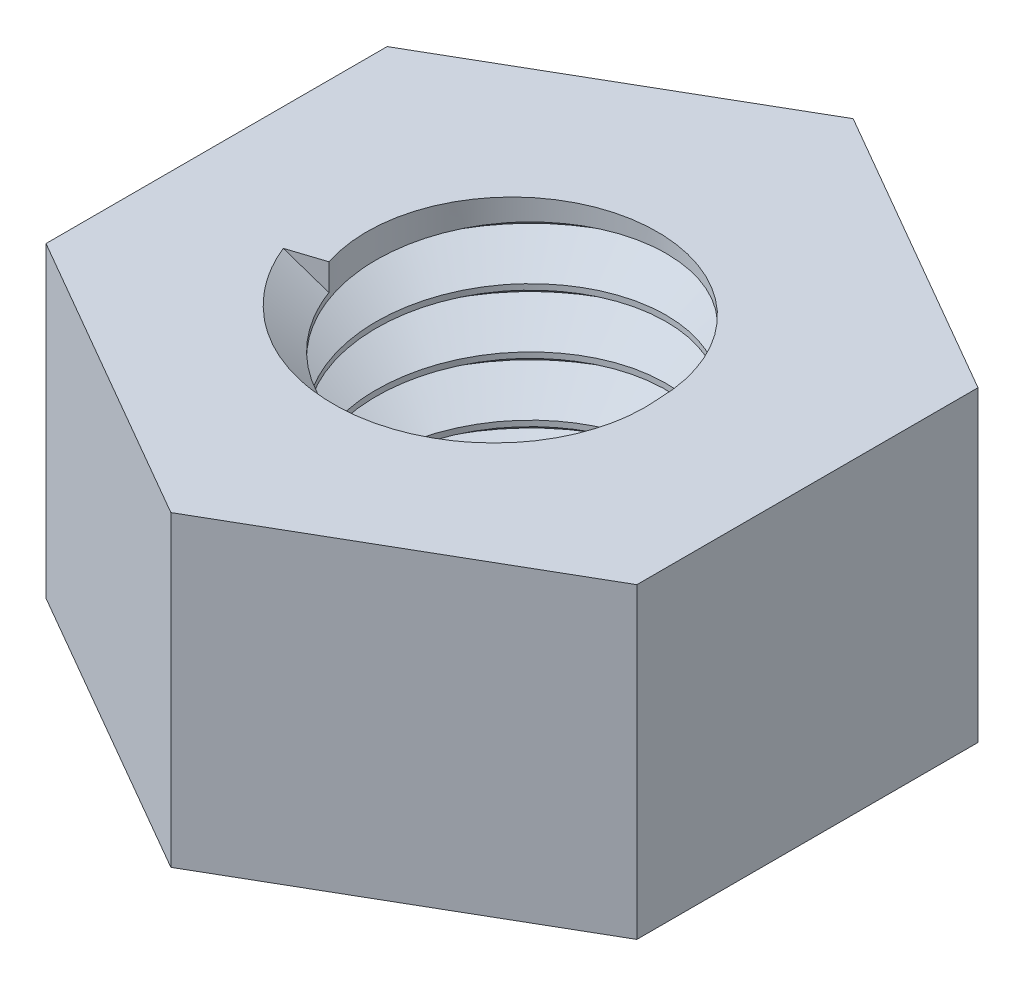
ISO-10303-21;
HEADER;
FILE_DESCRIPTION(('STEP AP214'),'2;1');
FILE_NAME('part.step','',(''),(''),'','','');
FILE_SCHEMA(('AUTOMOTIVE_DESIGN { 1 0 10303 214 1 1 1 1 }'));
ENDSEC;
DATA;
#1=APPLICATION_CONTEXT('core data for automotive mechanical design processes');
#2=APPLICATION_PROTOCOL_DEFINITION('international standard','automotive_design',2000,#1);
#3=PRODUCT_CONTEXT('',#1,'mechanical');
#4=PRODUCT('Part','Part','',(#3));
#5=PRODUCT_RELATED_PRODUCT_CATEGORY('part','',(#4));
#6=PRODUCT_DEFINITION_FORMATION('','',#4);
#7=PRODUCT_DEFINITION_CONTEXT('part definition',#1,'design');
#8=PRODUCT_DEFINITION('design','',#6,#7);
#9=PRODUCT_DEFINITION_SHAPE('','',#8);
#10=(LENGTH_UNIT() NAMED_UNIT(*) SI_UNIT(.MILLI.,.METRE.));
#11=(NAMED_UNIT(*) PLANE_ANGLE_UNIT() SI_UNIT($,.RADIAN.));
#12=(NAMED_UNIT(*) SI_UNIT($,.STERADIAN.) SOLID_ANGLE_UNIT());
#13=UNCERTAINTY_MEASURE_WITH_UNIT(LENGTH_MEASURE(1.E-05),#10,'distance_accuracy_value','');
#14=(GEOMETRIC_REPRESENTATION_CONTEXT(3) GLOBAL_UNCERTAINTY_ASSIGNED_CONTEXT((#13)) GLOBAL_UNIT_ASSIGNED_CONTEXT((#10,
#11,#12)) REPRESENTATION_CONTEXT('',''));
#15=CARTESIAN_POINT('',(0.,0.,0.));
#16=DIRECTION('',(0.,0.,1.));
#17=DIRECTION('',(1.,0.,0.));
#18=AXIS2_PLACEMENT_3D('',#15,#16,#17);
#19=CARTESIAN_POINT('',(0.,0.,0.));
#20=DIRECTION('',(0.,-1.,0.));
#21=DIRECTION('',(0.,0.,-1.));
#22=AXIS2_PLACEMENT_3D('',#19,#20,#21);
#23=PLANE('',#22);
#24=DIRECTION('',(0.,0.,-1.));
#25=VECTOR('',#24,1.);
#26=CARTESIAN_POINT('',(5.,0.,-2.88675134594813));
#27=LINE('',#26,#25);
#28=CARTESIAN_POINT('',(5.,0.,2.88675134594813));
#29=VERTEX_POINT('',#28);
#30=CARTESIAN_POINT('',(5.,0.,-2.88675134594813));
#31=VERTEX_POINT('',#30);
#32=EDGE_CURVE('E143',#29,#31,#27,.T.);
#33=ORIENTED_EDGE('',*,*,#32,.F.);
#34=DIRECTION('',(0.866025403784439,0.,-0.5));
#35=VECTOR('',#34,1.);
#36=CARTESIAN_POINT('',(5.,0.,2.88675134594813));
#37=LINE('',#36,#35);
#38=CARTESIAN_POINT('',(0.,0.,5.77350269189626));
#39=VERTEX_POINT('',#38);
#40=EDGE_CURVE('E97',#39,#29,#37,.T.);
#41=ORIENTED_EDGE('',*,*,#40,.F.);
#42=DIRECTION('',(0.866025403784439,0.,0.5));
#43=VECTOR('',#42,1.);
#44=CARTESIAN_POINT('',(0.,0.,5.77350269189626));
#45=LINE('',#44,#43);
#46=CARTESIAN_POINT('',(-5.,0.,2.88675134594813));
#47=VERTEX_POINT('',#46);
#48=EDGE_CURVE('E152',#47,#39,#45,.T.);
#49=ORIENTED_EDGE('',*,*,#48,.F.);
#50=DIRECTION('',(0.,0.,1.));
#51=VECTOR('',#50,1.);
#52=CARTESIAN_POINT('',(-5.,0.,2.88675134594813));
#53=LINE('',#52,#51);
#54=CARTESIAN_POINT('',(-5.,0.,-2.88675134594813));
#55=VERTEX_POINT('',#54);
#56=EDGE_CURVE('E131',#55,#47,#53,.T.);
#57=ORIENTED_EDGE('',*,*,#56,.F.);
#58=DIRECTION('',(-0.866025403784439,0.,0.5));
#59=VECTOR('',#58,1.);
#60=CARTESIAN_POINT('',(-5.,0.,-2.88675134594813));
#61=LINE('',#60,#59);
#62=CARTESIAN_POINT('',(0.,0.,-5.77350269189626));
#63=VERTEX_POINT('',#62);
#64=EDGE_CURVE('E149',#63,#55,#61,.T.);
#65=ORIENTED_EDGE('',*,*,#64,.F.);
#66=DIRECTION('',(-0.866025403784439,0.,-0.5));
#67=VECTOR('',#66,1.);
#68=CARTESIAN_POINT('',(0.,0.,-5.77350269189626));
#69=LINE('',#68,#67);
#70=EDGE_CURVE('E146',#31,#63,#69,.T.);
#71=ORIENTED_EDGE('',*,*,#70,.F.);
#72=EDGE_LOOP('',(#33,#41,#49,#57,#65,#71));
#73=FACE_BOUND('',#72,.T.);
#74=CARTESIAN_POINT('',(0.,0.,-2.39426666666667));
#75=CARTESIAN_POINT('',(-0.069242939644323,0.,-2.40018335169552));
#76=CARTESIAN_POINT('',(-0.138705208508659,0.,-2.40317420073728));
#77=CARTESIAN_POINT('',(-0.277633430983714,0.,-2.40329824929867));
#78=CARTESIAN_POINT('',(-0.347099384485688,0.,-2.40043157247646));
#79=CARTESIAN_POINT('',(-0.554665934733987,0.,-2.38305228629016));
#80=CARTESIAN_POINT('',(-0.692126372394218,0.,-2.35977656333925));
#81=CARTESIAN_POINT('',(-0.961216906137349,0.,-2.29042649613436));
#82=CARTESIAN_POINT('',(-1.09284525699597,0.,-2.24434537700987));
#83=CARTESIAN_POINT('',(-1.28294209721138,0.,-2.1592394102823));
#84=CARTESIAN_POINT('',(-1.34509287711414,0.,-2.128200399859));
#85=CARTESIAN_POINT('',(-1.46656785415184,0.,-2.06099838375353));
#86=CARTESIAN_POINT('',(-1.52589234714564,0.,-2.02483591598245));
#87=CARTESIAN_POINT('',(-1.64123170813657,0.,-1.94769855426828));
#88=CARTESIAN_POINT('',(-1.69725036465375,0.,-1.90672933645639));
#89=CARTESIAN_POINT('',(-1.77851584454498,0.,-1.84184290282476));
#90=CARTESIAN_POINT('',(-1.80514676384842,0.,-1.81963929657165));
#91=CARTESIAN_POINT('',(-1.85750854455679,0.,-1.77418667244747));
#92=CARTESIAN_POINT('',(-1.88323922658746,0.,-1.75093744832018));
#93=CARTESIAN_POINT('',(-1.95905700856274,0.,-1.67967277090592));
#94=CARTESIAN_POINT('',(-2.00775105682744,0.,-1.63015537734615));
#95=CARTESIAN_POINT('',(-2.10108645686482,0.,-1.52744436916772));
#96=CARTESIAN_POINT('',(-2.1457265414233,0.,-1.4742496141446));
#97=CARTESIAN_POINT('',(-2.27688479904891,0.,-1.30477413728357));
#98=CARTESIAN_POINT('',(-2.35619183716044,0.,-1.18276012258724));
#99=CARTESIAN_POINT('',(-2.49362113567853,0.,-0.927564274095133));
#100=CARTESIAN_POINT('',(-2.55175771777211,0.,-0.794390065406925));
#101=CARTESIAN_POINT('',(-2.64656386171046,0.,-0.516890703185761));
#102=CARTESIAN_POINT('',(-2.68268715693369,0.,-0.37237511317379));
#103=CARTESIAN_POINT('',(-2.71238209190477,0.,-0.189443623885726));
#104=CARTESIAN_POINT('',(-2.71755389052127,0.,-0.152688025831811));
#105=CARTESIAN_POINT('',(-2.72633703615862,0.,-0.0789903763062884));
#106=CARTESIAN_POINT('',(-2.72994867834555,0.,-0.0420483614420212));
#107=CARTESIAN_POINT('',(-2.73565205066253,0.,0.0319442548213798));
#108=CARTESIAN_POINT('',(-2.73774403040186,0.,0.068994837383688));
#109=CARTESIAN_POINT('',(-2.74047434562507,0.,0.143149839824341));
#110=CARTESIAN_POINT('',(-2.74111257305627,0.,0.180254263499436));
#111=CARTESIAN_POINT('',(-2.74081406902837,0.,0.29259541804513));
#112=CARTESIAN_POINT('',(-2.73758541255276,0.,0.367841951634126));
#113=CARTESIAN_POINT('',(-2.72511057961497,0.,0.517799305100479));
#114=CARTESIAN_POINT('',(-2.71586493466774,0.,0.592510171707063));
#115=CARTESIAN_POINT('',(-2.67916178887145,0.,0.815130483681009));
#116=CARTESIAN_POINT('',(-2.6427375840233,0.,0.961670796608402));
#117=CARTESIAN_POINT('',(-2.54454832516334,0.,1.2540748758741));
#118=CARTESIAN_POINT('',(-2.48161040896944,0.,1.39954066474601));
#119=CARTESIAN_POINT('',(-2.33212727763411,0.,1.6779656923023));
#120=CARTESIAN_POINT('',(-2.2455808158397,0.,1.81092427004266));
#121=CARTESIAN_POINT('',(-2.12443204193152,0.,1.96663499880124));
#122=CARTESIAN_POINT('',(-2.09956017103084,0.,1.99724570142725));
#123=CARTESIAN_POINT('',(-2.04856201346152,0.,2.05740176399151));
#124=CARTESIAN_POINT('',(-2.02243592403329,0.,2.08694729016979));
#125=CARTESIAN_POINT('',(-1.94233592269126,0.,2.17401075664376));
#126=CARTESIAN_POINT('',(-1.88663896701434,0.,2.22995725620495));
#127=CARTESIAN_POINT('',(-1.77094617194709,0.,2.33727139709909));
#128=CARTESIAN_POINT('',(-1.71094820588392,0.,2.38863674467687));
#129=CARTESIAN_POINT('',(-1.58708818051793,0.,2.48643529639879));
#130=CARTESIAN_POINT('',(-1.52322640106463,0.,2.53286885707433));
#131=CARTESIAN_POINT('',(-1.31964385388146,0.,2.66884133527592));
#132=CARTESIAN_POINT('',(-1.17385271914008,0.,2.74951859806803));
#133=CARTESIAN_POINT('',(-0.871027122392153,0.,2.88539261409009));
#134=CARTESIAN_POINT('',(-0.71400310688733,0.,2.94061269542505));
#135=CARTESIAN_POINT('',(-0.462929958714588,0.,3.00602035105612));
#136=CARTESIAN_POINT('',(-0.371174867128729,0.,3.02534905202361));
#137=CARTESIAN_POINT('',(-0.186389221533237,0.,3.05527697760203));
#138=CARTESIAN_POINT('',(-0.093360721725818,0.,3.06588888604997));
#139=CARTESIAN_POINT('',(0.,0.,3.0721));
#140=B_SPLINE_CURVE_WITH_KNOTS('',3,(#74,#75,#76,#77,#78,#79,#80,#81,#82,#83,#84,#85,#86,#87,
#88,#89,#90,#91,#92,#93,#94,#95,#96,#97,#98,#99,#100,#101,#102,#103,#104,#105,#106,#107,#108,
#109,#110,#111,#112,#113,#114,#115,#116,#117,#118,#119,#120,#121,#122,#123,#124,#125,#126,#127,
#128,#129,#130,#131,#132,#133,#134,#135,#136,#137,#138,#139),.UNSPECIFIED.,.F.,.F.,(4,2,2,2,2,2,
2,2,2,2,2,2,2,2,2,2,2,2,2,2,2,2,2,2,2,2,2,2,2,2,2,2,4),(0.,0.208363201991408,0.41672200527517,
0.832871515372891,1.24914472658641,1.45734861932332,1.66553066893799,1.87346931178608,
1.97746205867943,2.08147540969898,2.28957416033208,2.49773773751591,2.93212710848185,
3.3662220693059,3.81069183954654,3.92203010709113,4.03334730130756,4.14464620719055,
4.25595338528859,4.48162260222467,4.70727188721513,5.15814588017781,5.63149876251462,
6.10487664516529,6.2231836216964,6.3414720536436,6.57804256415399,6.81473086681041,
7.05140204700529,7.54878357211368,8.04570840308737,8.32663810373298,8.60715829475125),.UNSPECIFIED.);
#141=CARTESIAN_POINT('',(-0.729263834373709,0.,-2.34811111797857));
#142=VERTEX_POINT('',#141);
#143=CARTESIAN_POINT('',(0.,0.,3.0721));
#144=VERTEX_POINT('',#143);
#145=EDGE_CURVE('E227',#142,#144,#140,.T.);
#146=ORIENTED_EDGE('',*,*,#145,.T.);
#147=DIRECTION('',(0.,0.,-1.));
#148=VECTOR('',#147,1.);
#149=CARTESIAN_POINT('',(0.,0.,0.));
#150=LINE('',#149,#148);
#151=CARTESIAN_POINT('',(0.,0.,2.45875));
#152=VERTEX_POINT('',#151);
#153=EDGE_CURVE('E168',#144,#152,#150,.T.);
#154=ORIENTED_EDGE('',*,*,#153,.T.);
#155=CARTESIAN_POINT('',(0.,0.,0.));
#156=DIRECTION('',(0.,-1.,0.));
#157=DIRECTION('',(0.,0.,-1.));
#158=AXIS2_PLACEMENT_3D('',#155,#156,#157);
#159=CIRCLE('',#158,2.45875);
#160=EDGE_CURVE('E165',#142,#152,#159,.T.);
#161=ORIENTED_EDGE('',*,*,#160,.F.);
#162=EDGE_LOOP('',(#146,#154,#161));
#163=FACE_BOUND('',#162,.T.);
#164=ADVANCED_FACE('F43',(#73,#163),#23,.T.);
#165=CARTESIAN_POINT('',(5.,5.2,-2.88675134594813));
#166=DIRECTION('',(-1.,0.,0.));
#167=DIRECTION('',(0.,0.,1.));
#168=AXIS2_PLACEMENT_3D('',#165,#166,#167);
#169=PLANE('',#168);
#170=ORIENTED_EDGE('',*,*,#32,.T.);
#171=DIRECTION('',(0.,-1.,0.));
#172=VECTOR('',#171,1.);
#173=CARTESIAN_POINT('',(5.,5.2,-2.88675134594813));
#174=LINE('',#173,#172);
#175=CARTESIAN_POINT('',(5.,5.2,-2.88675134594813));
#176=VERTEX_POINT('',#175);
#177=EDGE_CURVE('E162',#176,#31,#174,.T.);
#178=ORIENTED_EDGE('',*,*,#177,.F.);
#179=DIRECTION('',(0.,0.,-1.));
#180=VECTOR('',#179,1.);
#181=CARTESIAN_POINT('',(5.,5.2,-2.88675134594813));
#182=LINE('',#181,#180);
#183=CARTESIAN_POINT('',(5.,5.2,2.88675134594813));
#184=VERTEX_POINT('',#183);
#185=EDGE_CURVE('E155',#184,#176,#182,.T.);
#186=ORIENTED_EDGE('',*,*,#185,.F.);
#187=DIRECTION('',(0.,-1.,0.));
#188=VECTOR('',#187,1.);
#189=CARTESIAN_POINT('',(5.,5.2,2.88675134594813));
#190=LINE('',#189,#188);
#191=EDGE_CURVE('E139',#184,#29,#190,.T.);
#192=ORIENTED_EDGE('',*,*,#191,.T.);
#193=EDGE_LOOP('',(#170,#178,#186,#192));
#194=FACE_BOUND('',#193,.T.);
#195=ADVANCED_FACE('F45',(#194),#169,.F.);
#196=CARTESIAN_POINT('',(0.,5.2,-5.77350269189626));
#197=DIRECTION('',(-0.5,0.,0.866025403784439));
#198=DIRECTION('',(0.866025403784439,0.,0.5));
#199=AXIS2_PLACEMENT_3D('',#196,#197,#198);
#200=PLANE('',#199);
#201=ORIENTED_EDGE('',*,*,#70,.T.);
#202=DIRECTION('',(0.,-1.,0.));
#203=VECTOR('',#202,1.);
#204=CARTESIAN_POINT('',(0.,5.2,-5.77350269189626));
#205=LINE('',#204,#203);
#206=CARTESIAN_POINT('',(0.,5.2,-5.77350269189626));
#207=VERTEX_POINT('',#206);
#208=EDGE_CURVE('E159',#207,#63,#205,.T.);
#209=ORIENTED_EDGE('',*,*,#208,.F.);
#210=DIRECTION('',(-0.866025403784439,0.,-0.5));
#211=VECTOR('',#210,1.);
#212=CARTESIAN_POINT('',(0.,5.2,-5.77350269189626));
#213=LINE('',#212,#211);
#214=EDGE_CURVE('E106',#176,#207,#213,.T.);
#215=ORIENTED_EDGE('',*,*,#214,.F.);
#216=ORIENTED_EDGE('',*,*,#177,.T.);
#217=EDGE_LOOP('',(#201,#209,#215,#216));
#218=FACE_BOUND('',#217,.T.);
#219=ADVANCED_FACE('F274',(#218),#200,.F.);
#220=CARTESIAN_POINT('',(-5.,5.2,-2.88675134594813));
#221=DIRECTION('',(0.5,0.,0.866025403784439));
#222=DIRECTION('',(0.866025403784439,0.,-0.5));
#223=AXIS2_PLACEMENT_3D('',#220,#221,#222);
#224=PLANE('',#223);
#225=ORIENTED_EDGE('',*,*,#64,.T.);
#226=DIRECTION('',(0.,-1.,0.));
#227=VECTOR('',#226,1.);
#228=CARTESIAN_POINT('',(-5.,5.2,-2.88675134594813));
#229=LINE('',#228,#227);
#230=CARTESIAN_POINT('',(-5.,5.2,-2.88675134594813));
#231=VERTEX_POINT('',#230);
#232=EDGE_CURVE('E134',#231,#55,#229,.T.);
#233=ORIENTED_EDGE('',*,*,#232,.F.);
#234=DIRECTION('',(-0.866025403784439,0.,0.5));
#235=VECTOR('',#234,1.);
#236=CARTESIAN_POINT('',(-5.,5.2,-2.88675134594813));
#237=LINE('',#236,#235);
#238=EDGE_CURVE('E122',#207,#231,#237,.T.);
#239=ORIENTED_EDGE('',*,*,#238,.F.);
#240=ORIENTED_EDGE('',*,*,#208,.T.);
#241=EDGE_LOOP('',(#225,#233,#239,#240));
#242=FACE_BOUND('',#241,.T.);
#243=ADVANCED_FACE('F277',(#242),#224,.F.);
#244=CARTESIAN_POINT('',(-5.,5.2,2.88675134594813));
#245=DIRECTION('',(1.,0.,0.));
#246=DIRECTION('',(0.,0.,-1.));
#247=AXIS2_PLACEMENT_3D('',#244,#245,#246);
#248=PLANE('',#247);
#249=ORIENTED_EDGE('',*,*,#56,.T.);
#250=DIRECTION('',(0.,-1.,0.));
#251=VECTOR('',#250,1.);
#252=CARTESIAN_POINT('',(-5.,5.2,2.88675134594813));
#253=LINE('',#252,#251);
#254=CARTESIAN_POINT('',(-5.,5.2,2.88675134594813));
#255=VERTEX_POINT('',#254);
#256=EDGE_CURVE('E128',#255,#47,#253,.T.);
#257=ORIENTED_EDGE('',*,*,#256,.F.);
#258=DIRECTION('',(0.,0.,1.));
#259=VECTOR('',#258,1.);
#260=CARTESIAN_POINT('',(-5.,5.2,2.88675134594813));
#261=LINE('',#260,#259);
#262=EDGE_CURVE('E115',#231,#255,#261,.T.);
#263=ORIENTED_EDGE('',*,*,#262,.F.);
#264=ORIENTED_EDGE('',*,*,#232,.T.);
#265=EDGE_LOOP('',(#249,#257,#263,#264));
#266=FACE_BOUND('',#265,.T.);
#267=ADVANCED_FACE('F129',(#266),#248,.F.);
#268=CARTESIAN_POINT('',(0.,5.2,5.77350269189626));
#269=DIRECTION('',(0.5,0.,-0.866025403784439));
#270=DIRECTION('',(-0.866025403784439,0.,-0.5));
#271=AXIS2_PLACEMENT_3D('',#268,#269,#270);
#272=PLANE('',#271);
#273=ORIENTED_EDGE('',*,*,#48,.T.);
#274=DIRECTION('',(0.,-1.,0.));
#275=VECTOR('',#274,1.);
#276=CARTESIAN_POINT('',(0.,5.2,5.77350269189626));
#277=LINE('',#276,#275);
#278=CARTESIAN_POINT('',(0.,5.2,5.77350269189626));
#279=VERTEX_POINT('',#278);
#280=EDGE_CURVE('E135',#279,#39,#277,.T.);
#281=ORIENTED_EDGE('',*,*,#280,.F.);
#282=DIRECTION('',(0.866025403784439,0.,0.5));
#283=VECTOR('',#282,1.);
#284=CARTESIAN_POINT('',(0.,5.2,5.77350269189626));
#285=LINE('',#284,#283);
#286=EDGE_CURVE('E119',#255,#279,#285,.T.);
#287=ORIENTED_EDGE('',*,*,#286,.F.);
#288=ORIENTED_EDGE('',*,*,#256,.T.);
#289=EDGE_LOOP('',(#273,#281,#287,#288));
#290=FACE_BOUND('',#289,.T.);
#291=ADVANCED_FACE('F137',(#290),#272,.F.);
#292=CARTESIAN_POINT('',(5.,5.2,2.88675134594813));
#293=DIRECTION('',(-0.5,0.,-0.866025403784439));
#294=DIRECTION('',(-0.866025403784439,0.,0.5));
#295=AXIS2_PLACEMENT_3D('',#292,#293,#294);
#296=PLANE('',#295);
#297=ORIENTED_EDGE('',*,*,#40,.T.);
#298=ORIENTED_EDGE('',*,*,#191,.F.);
#299=DIRECTION('',(0.866025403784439,0.,-0.5));
#300=VECTOR('',#299,1.);
#301=CARTESIAN_POINT('',(5.,5.2,2.88675134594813));
#302=LINE('',#301,#300);
#303=EDGE_CURVE('E70',#279,#184,#302,.T.);
#304=ORIENTED_EDGE('',*,*,#303,.F.);
#305=ORIENTED_EDGE('',*,*,#280,.T.);
#306=EDGE_LOOP('',(#297,#298,#304,#305));
#307=FACE_BOUND('',#306,.T.);
#308=ADVANCED_FACE('F213',(#307),#296,.F.);
#309=CARTESIAN_POINT('',(0.,5.2,0.));
#310=DIRECTION('',(0.,-1.,0.));
#311=DIRECTION('',(0.,0.,-1.));
#312=AXIS2_PLACEMENT_3D('',#309,#310,#311);
#313=PLANE('',#312);
#314=CARTESIAN_POINT('',(-2.92133192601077,5.2,0.949215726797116));
#315=CARTESIAN_POINT('',(-2.90320617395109,5.2,1.02249728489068));
#316=CARTESIAN_POINT('',(-2.88240226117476,5.2,1.09507253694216));
#317=CARTESIAN_POINT('',(-2.83551593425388,5.2,1.23853468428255));
#318=CARTESIAN_POINT('',(-2.80943106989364,5.2,1.30942077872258));
#319=CARTESIAN_POINT('',(-2.72410030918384,5.2,1.517325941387));
#320=CARTESIAN_POINT('',(-2.65733020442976,5.2,1.65139430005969));
#321=CARTESIAN_POINT('',(-2.57024127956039,5.2,1.79846448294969));
#322=CARTESIAN_POINT('',(-2.55895515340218,5.2,1.81707001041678));
#323=CARTESIAN_POINT('',(-2.54747527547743,5.2,1.83554816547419));
#324=B_SPLINE_CURVE_WITH_KNOTS('',3,(#314,#315,#316,#317,#318,#319,#320,#321,#322,#323),
.UNSPECIFIED.,.F.,.F.,(4,2,2,2,4),(0.,0.22633364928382,0.452772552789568,0.900128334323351,
0.96540531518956),.UNSPECIFIED.);
#325=CARTESIAN_POINT('',(-2.92153843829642,5.20008191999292,0.949277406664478));
#326=VERTEX_POINT('',#325);
#327=CARTESIAN_POINT('',(-2.91990478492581,5.2,0.954963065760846));
#328=VERTEX_POINT('',#327);
#329=EDGE_CURVE('E47',#326,#328,#324,.T.);
#330=ORIENTED_EDGE('',*,*,#329,.F.);
#331=DIRECTION('',(0.951056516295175,0.,-0.309016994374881));
#332=VECTOR('',#331,1.);
#333=CARTESIAN_POINT('',(0.,5.2,0.));
#334=LINE('',#333,#332);
#335=CARTESIAN_POINT('',(-2.33841020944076,5.2,0.759795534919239));
#336=VERTEX_POINT('',#335);
#337=EDGE_CURVE('E233',#326,#336,#334,.T.);
#338=ORIENTED_EDGE('',*,*,#337,.T.);
#339=CARTESIAN_POINT('',(0.,5.2,0.));
#340=DIRECTION('',(0.,-1.,0.));
#341=DIRECTION('',(0.,0.,-1.));
#342=AXIS2_PLACEMENT_3D('',#339,#340,#341);
#343=CIRCLE('',#342,2.45875);
#344=CARTESIAN_POINT('',(2.45843214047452,5.2,-0.0395344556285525));
#345=VERTEX_POINT('',#344);
#346=EDGE_CURVE('E147',#336,#345,#343,.T.);
#347=ORIENTED_EDGE('',*,*,#346,.T.);
#348=CARTESIAN_POINT('',(2.27565206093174,5.2,-0.744258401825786));
#349=CARTESIAN_POINT('',(2.3021538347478,5.2,-0.68296725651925));
#350=CARTESIAN_POINT('',(2.32605030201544,5.2,-0.620554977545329));
#351=CARTESIAN_POINT('',(2.3684942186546,5.2,-0.493932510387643));
#352=CARTESIAN_POINT('',(2.38704130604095,5.2,-0.429722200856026));
#353=CARTESIAN_POINT('',(2.41856518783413,5.2,-0.300281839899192));
#354=CARTESIAN_POINT('',(2.43156945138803,5.2,-0.235058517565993));
#355=CARTESIAN_POINT('',(2.44694123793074,5.2,-0.136606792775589));
#356=CARTESIAN_POINT('',(2.45137592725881,5.2,-0.103688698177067));
#357=CARTESIAN_POINT('',(2.45884396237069,5.2,-0.0376945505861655));
#358=CARTESIAN_POINT('',(2.46187739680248,5.2,-0.0046185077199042));
#359=CARTESIAN_POINT('',(2.46664299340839,5.2,0.0617227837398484));
#360=CARTESIAN_POINT('',(2.46837134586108,5.2,0.0949883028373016));
#361=CARTESIAN_POINT('',(2.47052032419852,5.2,0.161554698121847));
#362=CARTESIAN_POINT('',(2.47094115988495,5.2,0.194855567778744));
#363=CARTESIAN_POINT('',(2.47023664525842,5.2,0.294742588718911));
#364=CARTESIAN_POINT('',(2.46714513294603,5.2,0.36132514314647));
#365=CARTESIAN_POINT('',(2.4557279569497,5.2,0.49409060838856));
#366=CARTESIAN_POINT('',(2.44739824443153,5.2,0.560273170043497));
#367=CARTESIAN_POINT('',(2.42556554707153,5.2,0.691757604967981));
#368=CARTESIAN_POINT('',(2.41206247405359,5.2,0.757059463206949));
#369=CARTESIAN_POINT('',(2.36159815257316,5.2,0.960219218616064));
#370=CARTESIAN_POINT('',(2.3154394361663,5.2,1.09596369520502));
#371=CARTESIAN_POINT('',(2.22972303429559,5.2,1.29208518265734));
#372=CARTESIAN_POINT('',(2.19839334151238,5.2,1.35622685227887));
#373=CARTESIAN_POINT('',(2.13043976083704,5.2,1.48166274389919));
#374=CARTESIAN_POINT('',(2.09381646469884,5.2,1.54295728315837));
#375=CARTESIAN_POINT('',(2.01559438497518,5.2,1.66218080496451));
#376=CARTESIAN_POINT('',(1.97400124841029,5.2,1.72011349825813));
#377=CARTESIAN_POINT('',(1.88606910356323,5.2,1.832259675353));
#378=CARTESIAN_POINT('',(1.83972956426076,5.2,1.8864727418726));
#379=CARTESIAN_POINT('',(1.74291216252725,5.2,1.99113078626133));
#380=CARTESIAN_POINT('',(1.69243161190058,5.2,2.04157327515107));
#381=CARTESIAN_POINT('',(1.58765910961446,5.2,2.13830380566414));
#382=CARTESIAN_POINT('',(1.53336724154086,5.2,2.18459193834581));
#383=CARTESIAN_POINT('',(1.36067222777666,5.2,2.32039755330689));
#384=CARTESIAN_POINT('',(1.23636647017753,5.2,2.40259994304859));
#385=CARTESIAN_POINT('',(0.976136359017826,5.2,2.5454431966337));
#386=CARTESIAN_POINT('',(0.84021892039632,5.2,2.60609678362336));
#387=CARTESIAN_POINT('',(0.556613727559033,5.2,2.70562547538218));
#388=CARTESIAN_POINT('',(0.408714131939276,5.2,2.74390538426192));
#389=CARTESIAN_POINT('',(0.18373797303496,5.2,2.7823174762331));
#390=CARTESIAN_POINT('',(0.108169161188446,5.2,2.79195362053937));
#391=CARTESIAN_POINT('',(-0.0055900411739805,5.2,2.801640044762));
#392=CARTESIAN_POINT('',(-0.0435814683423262,5.2,2.80407422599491));
#393=CARTESIAN_POINT('',(-0.119637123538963,5.2,2.80745196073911));
#394=CARTESIAN_POINT('',(-0.15770136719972,5.2,2.80839514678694));
#395=CARTESIAN_POINT('',(-0.272762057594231,5.2,2.80895631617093));
#396=CARTESIAN_POINT('',(-0.349786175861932,5.2,2.80623450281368));
#397=CARTESIAN_POINT('',(-0.503362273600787,5.2,2.79463275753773));
#398=CARTESIAN_POINT('',(-0.57991411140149,5.2,2.78575106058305));
#399=CARTESIAN_POINT('',(-0.808066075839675,5.2,2.74992404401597));
#400=CARTESIAN_POINT('',(-0.958335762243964,5.2,2.71379750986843));
#401=CARTESIAN_POINT('',(-1.25847096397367,5.2,2.61559312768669));
#402=CARTESIAN_POINT('',(-1.40793429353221,5.2,2.55229894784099));
#403=CARTESIAN_POINT('',(-1.69427766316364,5.2,2.40140945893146));
#404=CARTESIAN_POINT('',(-1.83115341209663,5.2,2.3138059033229));
#405=CARTESIAN_POINT('',(-1.99164163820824,5.2,2.19093092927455));
#406=CARTESIAN_POINT('',(-2.02321858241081,5.2,2.16567914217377));
#407=CARTESIAN_POINT('',(-2.08527741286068,5.2,2.11386614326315));
#408=CARTESIAN_POINT('',(-2.1157594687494,5.2,2.08730513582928));
#409=CARTESIAN_POINT('',(-2.20560123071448,5.2,2.00583039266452));
#410=CARTESIAN_POINT('',(-2.26335305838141,5.2,1.94912761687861));
#411=CARTESIAN_POINT('',(-2.3740923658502,5.2,1.83137915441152));
#412=CARTESIAN_POINT('',(-2.42708528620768,5.2,1.77033857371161));
#413=CARTESIAN_POINT('',(-2.52803800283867,5.2,1.64426692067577));
#414=CARTESIAN_POINT('',(-2.5759997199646,5.2,1.57923738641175));
#415=CARTESIAN_POINT('',(-2.66817009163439,5.2,1.44326616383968));
#416=CARTESIAN_POINT('',(-2.71219258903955,5.2,1.37219799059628));
#417=CARTESIAN_POINT('',(-2.7942606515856,5.2,1.22667988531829));
#418=CARTESIAN_POINT('',(-2.83230408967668,5.2,1.15222876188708));
#419=CARTESIAN_POINT('',(-2.93803967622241,5.2,0.922400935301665));
#420=CARTESIAN_POINT('',(-2.99605224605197,5.2,0.762444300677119));
#421=CARTESIAN_POINT('',(-3.08463790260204,5.2,0.435210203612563));
#422=CARTESIAN_POINT('',(-3.11523309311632,5.19999999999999,0.267938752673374));
#423=CARTESIAN_POINT('',(-3.13501543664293,5.2,0.0663788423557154));
#424=CARTESIAN_POINT('',(-3.13772297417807,5.2,0.0332020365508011));
#425=CARTESIAN_POINT('',(-3.13988333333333,5.2,-2.81553450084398E-13));
#426=B_SPLINE_CURVE_WITH_KNOTS('',3,(#348,#349,#350,#351,#352,#353,#354,#355,#356,#357,#358,
#359,#360,#361,#362,#363,#364,#365,#366,#367,#368,#369,#370,#371,#372,#373,#374,#375,#376,#377,
#378,#379,#380,#381,#382,#383,#384,#385,#386,#387,#388,#389,#390,#391,#392,#393,#394,#395,#396,
#397,#398,#399,#400,#401,#402,#403,#404,#405,#406,#407,#408,#409,#410,#411,#412,#413,#414,#415,
#416,#417,#418,#419,#420,#421,#422,#423,#424,#425),.UNSPECIFIED.,.F.,.F.,(4,2,2,2,2,2,2,2,2,2,2,
2,2,2,2,2,2,2,2,2,2,2,2,2,2,2,2,2,2,2,2,2,2,2,2,2,2,2,4),(0.,0.200257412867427,0.40052837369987,
0.599794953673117,0.699416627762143,0.799031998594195,0.898937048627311,0.998826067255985,
1.19856813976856,1.39846479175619,1.59836485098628,2.02604882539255,2.24001162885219,
2.45395053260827,2.66764861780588,2.88137063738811,3.09523251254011,3.30908969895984,
3.75395903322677,4.19856526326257,4.65451618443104,4.88282119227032,4.99699778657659,
5.1112025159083,5.34213489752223,5.57313347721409,6.0346172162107,6.51936289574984,
7.0042732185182,7.12555149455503,7.24681089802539,7.48934282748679,7.73159385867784,
7.97375206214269,8.22425066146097,8.47483817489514,8.98279604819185,9.49034403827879,
9.59018565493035),.UNSPECIFIED.);
#427=EDGE_CURVE('E61',#328,#345,#426,.F.);
#428=ORIENTED_EDGE('',*,*,#427,.F.);
#429=EDGE_LOOP('',(#330,#338,#347,#428));
#430=FACE_BOUND('',#429,.T.);
#431=ORIENTED_EDGE('',*,*,#185,.T.);
#432=ORIENTED_EDGE('',*,*,#214,.T.);
#433=ORIENTED_EDGE('',*,*,#238,.T.);
#434=ORIENTED_EDGE('',*,*,#262,.T.);
#435=ORIENTED_EDGE('',*,*,#286,.T.);
#436=ORIENTED_EDGE('',*,*,#303,.T.);
#437=EDGE_LOOP('',(#431,#432,#433,#434,#435,#436));
#438=FACE_BOUND('',#437,.T.);
#439=ADVANCED_FACE('F117',(#430,#438),#313,.F.);
#440=CARTESIAN_POINT('',(0.,-1.,0.));
#441=DIRECTION('',(0.,1.,0.));
#442=DIRECTION('',(0.,0.,1.));
#443=AXIS2_PLACEMENT_3D('',#440,#441,#442);
#444=CYLINDRICAL_SURFACE('',#443,2.45875);
#445=ORIENTED_EDGE('',*,*,#346,.F.);
#446=DIRECTION('',(0.,1.,0.));
#447=VECTOR('',#446,1.);
#448=CARTESIAN_POINT('',(-2.33841020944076,-1.,0.759795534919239));
#449=LINE('',#448,#447);
#450=CARTESIAN_POINT('',(-2.33840815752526,4.74772231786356,0.759801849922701));
#451=VERTEX_POINT('',#450);
#452=EDGE_CURVE('E12',#336,#451,#449,.F.);
#453=ORIENTED_EDGE('',*,*,#452,.T.);
#454=CARTESIAN_POINT('',(0.,-0.452434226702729,2.45875));
#455=CARTESIAN_POINT('',(-1.01844759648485,-0.389934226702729,2.45875));
#456=CARTESIAN_POINT('',(-1.73859879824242,-0.32743422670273,1.73859879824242));
#457=CARTESIAN_POINT('',(-2.45875,-0.26493422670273,1.01844759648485));
#458=CARTESIAN_POINT('',(-2.45875,-0.20243422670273,0.));
#459=CARTESIAN_POINT('',(-2.45875,-0.13993422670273,-1.01844759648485));
#460=CARTESIAN_POINT('',(-1.73859879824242,-0.0774342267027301,-1.73859879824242));
#461=CARTESIAN_POINT('',(-1.01844759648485,-0.0149342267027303,-2.45875));
#462=CARTESIAN_POINT('',(0.,0.0475657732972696,-2.45875));
#463=CARTESIAN_POINT('',(1.01844759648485,0.110065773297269,-2.45875));
#464=CARTESIAN_POINT('',(1.73859879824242,0.172565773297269,-1.73859879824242));
#465=CARTESIAN_POINT('',(2.45875,0.235065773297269,-1.01844759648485));
#466=CARTESIAN_POINT('',(2.45875,0.297565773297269,0.));
#467=CARTESIAN_POINT('',(2.45875,0.360065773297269,1.01844759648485));
#468=CARTESIAN_POINT('',(1.73859879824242,0.422565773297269,1.73859879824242));
#469=CARTESIAN_POINT('',(1.01844759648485,0.485065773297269,2.45875));
#470=CARTESIAN_POINT('',(0.,0.547565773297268,2.45875));
#471=CARTESIAN_POINT('',(-1.01844759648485,0.610065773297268,2.45875));
#472=CARTESIAN_POINT('',(-1.73859879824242,0.672565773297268,1.73859879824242));
#473=CARTESIAN_POINT('',(-2.45875,0.735065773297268,1.01844759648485));
#474=CARTESIAN_POINT('',(-2.45875,0.797565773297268,0.));
#475=CARTESIAN_POINT('',(-2.45875,0.860065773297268,-1.01844759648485));
#476=CARTESIAN_POINT('',(-1.73859879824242,0.922565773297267,-1.73859879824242));
#477=CARTESIAN_POINT('',(-1.01844759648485,0.985065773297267,-2.45875));
#478=CARTESIAN_POINT('',(0.,1.04756577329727,-2.45875));
#479=CARTESIAN_POINT('',(1.01844759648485,1.11006577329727,-2.45875));
#480=CARTESIAN_POINT('',(1.73859879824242,1.17256577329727,-1.73859879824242));
#481=CARTESIAN_POINT('',(2.45875,1.23506577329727,-1.01844759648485));
#482=CARTESIAN_POINT('',(2.45875,1.29756577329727,0.));
#483=CARTESIAN_POINT('',(2.45875,1.36006577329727,1.01844759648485));
#484=CARTESIAN_POINT('',(1.73859879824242,1.42256577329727,1.73859879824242));
#485=CARTESIAN_POINT('',(1.01844759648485,1.48506577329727,2.45875));
#486=CARTESIAN_POINT('',(0.,1.54756577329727,2.45875));
#487=CARTESIAN_POINT('',(-1.01844759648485,1.61006577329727,2.45875));
#488=CARTESIAN_POINT('',(-1.73859879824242,1.67256577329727,1.73859879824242));
#489=CARTESIAN_POINT('',(-2.45875,1.73506577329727,1.01844759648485));
#490=CARTESIAN_POINT('',(-2.45875,1.79756577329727,0.));
#491=CARTESIAN_POINT('',(-2.45875,1.86006577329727,-1.01844759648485));
#492=CARTESIAN_POINT('',(-1.73859879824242,1.92256577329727,-1.73859879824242));
#493=CARTESIAN_POINT('',(-1.01844759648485,1.98506577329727,-2.45875));
#494=CARTESIAN_POINT('',(0.,2.04756577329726,-2.45875));
#495=CARTESIAN_POINT('',(1.01844759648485,2.11006577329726,-2.45875));
#496=CARTESIAN_POINT('',(1.73859879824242,2.17256577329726,-1.73859879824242));
#497=CARTESIAN_POINT('',(2.45875,2.23506577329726,-1.01844759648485));
#498=CARTESIAN_POINT('',(2.45875,2.29756577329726,0.));
#499=CARTESIAN_POINT('',(2.45875,2.36006577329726,1.01844759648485));
#500=CARTESIAN_POINT('',(1.73859879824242,2.42256577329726,1.73859879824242));
#501=CARTESIAN_POINT('',(1.01844759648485,2.48506577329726,2.45875));
#502=CARTESIAN_POINT('',(0.,2.54756577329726,2.45875));
#503=CARTESIAN_POINT('',(-1.01844759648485,2.61006577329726,2.45875));
#504=CARTESIAN_POINT('',(-1.73859879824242,2.67256577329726,1.73859879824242));
#505=CARTESIAN_POINT('',(-2.45875,2.73506577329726,1.01844759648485));
#506=CARTESIAN_POINT('',(-2.45875,2.79756577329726,0.));
#507=CARTESIAN_POINT('',(-2.45875,2.86006577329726,-1.01844759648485));
#508=CARTESIAN_POINT('',(-1.73859879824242,2.92256577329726,-1.73859879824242));
#509=CARTESIAN_POINT('',(-1.01844759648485,2.98506577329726,-2.45875));
#510=CARTESIAN_POINT('',(0.,3.04756577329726,-2.45875));
#511=CARTESIAN_POINT('',(1.01844759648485,3.11006577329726,-2.45875));
#512=CARTESIAN_POINT('',(1.73859879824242,3.17256577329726,-1.73859879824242));
#513=CARTESIAN_POINT('',(2.45875,3.23506577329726,-1.01844759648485));
#514=CARTESIAN_POINT('',(2.45875,3.29756577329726,0.));
#515=CARTESIAN_POINT('',(2.45875,3.36006577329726,1.01844759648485));
#516=CARTESIAN_POINT('',(1.73859879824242,3.42256577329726,1.73859879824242));
#517=CARTESIAN_POINT('',(1.01844759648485,3.48506577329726,2.45875));
#518=CARTESIAN_POINT('',(0.,3.54756577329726,2.45875));
#519=CARTESIAN_POINT('',(-1.01844759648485,3.61006577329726,2.45875));
#520=CARTESIAN_POINT('',(-1.73859879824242,3.67256577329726,1.73859879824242));
#521=CARTESIAN_POINT('',(-2.45875,3.73506577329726,1.01844759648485));
#522=CARTESIAN_POINT('',(-2.45875,3.79756577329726,0.));
#523=CARTESIAN_POINT('',(-2.45875,3.86006577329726,-1.01844759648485));
#524=CARTESIAN_POINT('',(-1.73859879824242,3.92256577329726,-1.73859879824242));
#525=CARTESIAN_POINT('',(-1.01844759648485,3.98506577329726,-2.45875));
#526=CARTESIAN_POINT('',(0.,4.04756577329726,-2.45875));
#527=CARTESIAN_POINT('',(1.01844759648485,4.11006577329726,-2.45875));
#528=CARTESIAN_POINT('',(1.73859879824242,4.17256577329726,-1.73859879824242));
#529=CARTESIAN_POINT('',(2.45875,4.23506577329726,-1.01844759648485));
#530=CARTESIAN_POINT('',(2.45875,4.29756577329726,0.));
#531=CARTESIAN_POINT('',(2.45875,4.36006577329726,1.01844759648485));
#532=CARTESIAN_POINT('',(1.73859879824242,4.42256577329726,1.73859879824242));
#533=CARTESIAN_POINT('',(1.01844759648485,4.48506577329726,2.45875));
#534=CARTESIAN_POINT('',(0.,4.54756577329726,2.45875));
#535=CARTESIAN_POINT('',(-1.01844759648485,4.61006577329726,2.45875));
#536=CARTESIAN_POINT('',(-1.73859879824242,4.67256577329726,1.73859879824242));
#537=CARTESIAN_POINT('',(-2.45875,4.73506577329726,1.01844759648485));
#538=CARTESIAN_POINT('',(-2.45875,4.79756577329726,0.));
#539=CARTESIAN_POINT('',(-2.45875,4.86006577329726,-1.01844759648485));
#540=CARTESIAN_POINT('',(-1.73859879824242,4.92256577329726,-1.73859879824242));
#541=CARTESIAN_POINT('',(-1.01844759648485,4.98506577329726,-2.45875));
#542=CARTESIAN_POINT('',(0.,5.04756577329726,-2.45875));
#543=CARTESIAN_POINT('',(1.01844759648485,5.11006577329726,-2.45875));
#544=CARTESIAN_POINT('',(1.73859879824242,5.17256577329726,-1.73859879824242));
#545=CARTESIAN_POINT('',(2.45875,5.23506577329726,-1.01844759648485));
#546=CARTESIAN_POINT('',(2.45875,5.29756577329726,0.));
#547=CARTESIAN_POINT('',(2.45875,5.36006577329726,1.01844759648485));
#548=CARTESIAN_POINT('',(1.73859879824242,5.42256577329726,1.73859879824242));
#549=CARTESIAN_POINT('',(1.01844759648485,5.48506577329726,2.45875));
#550=CARTESIAN_POINT('',(0.,5.54756577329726,2.45875));
#551=(BOUNDED_CURVE() B_SPLINE_CURVE(2,(#454,#455,#456,#457,#458,#459,#460,#461,#462,#463,#464,
#465,#466,#467,#468,#469,#470,#471,#472,#473,#474,#475,#476,#477,#478,#479,#480,#481,#482,#483,
#484,#485,#486,#487,#488,#489,#490,#491,#492,#493,#494,#495,#496,#497,#498,#499,#500,#501,#502,
#503,#504,#505,#506,#507,#508,#509,#510,#511,#512,#513,#514,#515,#516,#517,#518,#519,#520,#521,
#522,#523,#524,#525,#526,#527,#528,#529,#530,#531,#532,#533,#534,#535,#536,#537,#538,#539,#540,
#541,#542,#543,#544,#545,#546,#547,#548,#549,#550),.UNSPECIFIED.,.F.,
.F.) B_SPLINE_CURVE_WITH_KNOTS((3,2,2,2,2,2,2,2,2,2,2,2,2,2,2,2,2,2,2,2,2,2,2,2,2,2,2,2,2,2,2,2,
2,2,2,2,2,2,2,2,2,2,2,2,2,2,2,2,3),(0.,0.0208333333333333,0.0416666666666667,0.0625,
0.0833333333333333,0.104166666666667,0.125,0.145833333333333,0.166666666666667,0.1875,
0.208333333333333,0.229166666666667,0.25,0.270833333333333,0.291666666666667,0.3125,
0.333333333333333,0.354166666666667,0.375,0.395833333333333,0.416666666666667,0.4375,
0.458333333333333,0.479166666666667,0.5,0.520833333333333,0.541666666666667,0.5625,
0.583333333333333,0.604166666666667,0.625,0.645833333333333,0.666666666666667,0.6875,
0.708333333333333,0.729166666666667,0.75,0.770833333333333,0.791666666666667,0.8125,
0.833333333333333,0.854166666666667,0.875,0.895833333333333,0.916666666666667,0.9375,
0.958333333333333,0.979166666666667,1.),
.UNSPECIFIED.) CURVE() GEOMETRIC_REPRESENTATION_ITEM() RATIONAL_B_SPLINE_CURVE((1.,
0.923879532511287,1.,0.923879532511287,1.,0.923879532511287,1.,0.923879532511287,1.,
0.923879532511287,1.,0.923879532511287,1.,0.923879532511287,1.,0.923879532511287,1.,
0.923879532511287,1.,0.923879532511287,1.,0.923879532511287,1.,0.923879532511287,1.,
0.923879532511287,1.,0.923879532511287,1.,0.923879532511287,1.,0.923879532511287,1.,
0.923879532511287,1.,0.923879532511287,1.,0.923879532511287,1.,0.923879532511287,1.,
0.923879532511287,1.,0.923879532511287,1.,0.923879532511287,1.,0.923879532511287,1.,
0.923879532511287,1.,0.923879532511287,1.,0.923879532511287,1.,0.923879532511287,1.,
0.923879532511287,1.,0.923879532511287,1.,0.923879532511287,1.,0.923879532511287,1.,
0.923879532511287,1.,0.923879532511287,1.,0.923879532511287,1.,0.923879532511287,1.,
0.923879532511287,1.,0.923879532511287,1.,0.923879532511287,1.,0.923879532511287,1.,
0.923879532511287,1.,0.923879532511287,1.,0.923879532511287,1.,0.923879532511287,1.,
0.923879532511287,1.,0.923879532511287,1.,0.923879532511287,1.,0.923879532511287,1.)) REPRESENTATION_ITEM(''));
#552=EDGE_CURVE('E53',#451,#142,#551,.F.);
#553=ORIENTED_EDGE('',*,*,#552,.T.);
#554=ORIENTED_EDGE('',*,*,#160,.T.);
#555=DIRECTION('',(0.,1.,0.));
#556=VECTOR('',#555,1.);
#557=CARTESIAN_POINT('',(0.,-1.,2.45875));
#558=LINE('',#557,#556);
#559=CARTESIAN_POINT('',(0.,0.452434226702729,2.45875));
#560=VERTEX_POINT('',#559);
#561=EDGE_CURVE('E172',#560,#152,#558,.F.);
#562=ORIENTED_EDGE('',*,*,#561,.F.);
#563=CARTESIAN_POINT('',(0.,0.452434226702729,2.45875));
#564=CARTESIAN_POINT('',(-1.01844759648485,0.514934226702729,2.45875));
#565=CARTESIAN_POINT('',(-1.73859879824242,0.577434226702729,1.73859879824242));
#566=CARTESIAN_POINT('',(-2.45875,0.639934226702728,1.01844759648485));
#567=CARTESIAN_POINT('',(-2.45875,0.702434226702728,0.));
#568=CARTESIAN_POINT('',(-2.45875,0.764934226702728,-1.01844759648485));
#569=CARTESIAN_POINT('',(-1.73859879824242,0.827434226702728,-1.73859879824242));
#570=CARTESIAN_POINT('',(-1.01844759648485,0.889934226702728,-2.45875));
#571=CARTESIAN_POINT('',(0.,0.952434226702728,-2.45875));
#572=CARTESIAN_POINT('',(1.01844759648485,1.01493422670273,-2.45875));
#573=CARTESIAN_POINT('',(1.73859879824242,1.07743422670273,-1.73859879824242));
#574=CARTESIAN_POINT('',(2.45875,1.13993422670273,-1.01844759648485));
#575=CARTESIAN_POINT('',(2.45875,1.20243422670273,0.));
#576=CARTESIAN_POINT('',(2.45875,1.26493422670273,1.01844759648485));
#577=CARTESIAN_POINT('',(1.73859879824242,1.32743422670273,1.73859879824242));
#578=CARTESIAN_POINT('',(1.01844759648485,1.38993422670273,2.45875));
#579=CARTESIAN_POINT('',(0.,1.45243422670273,2.45875));
#580=CARTESIAN_POINT('',(-1.01844759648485,1.51493422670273,2.45875));
#581=CARTESIAN_POINT('',(-1.73859879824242,1.57743422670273,1.73859879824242));
#582=CARTESIAN_POINT('',(-2.45875,1.63993422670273,1.01844759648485));
#583=CARTESIAN_POINT('',(-2.45875,1.70243422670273,0.));
#584=CARTESIAN_POINT('',(-2.45875,1.76493422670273,-1.01844759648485));
#585=CARTESIAN_POINT('',(-1.73859879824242,1.82743422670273,-1.73859879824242));
#586=CARTESIAN_POINT('',(-1.01844759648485,1.88993422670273,-2.45875));
#587=CARTESIAN_POINT('',(0.,1.95243422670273,-2.45875));
#588=CARTESIAN_POINT('',(1.01844759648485,2.01493422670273,-2.45875));
#589=CARTESIAN_POINT('',(1.73859879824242,2.07743422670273,-1.73859879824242));
#590=CARTESIAN_POINT('',(2.45875,2.13993422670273,-1.01844759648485));
#591=CARTESIAN_POINT('',(2.45875,2.20243422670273,0.));
#592=CARTESIAN_POINT('',(2.45875,2.26493422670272,1.01844759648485));
#593=CARTESIAN_POINT('',(1.73859879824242,2.32743422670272,1.73859879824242));
#594=CARTESIAN_POINT('',(1.01844759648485,2.38993422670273,2.45875));
#595=CARTESIAN_POINT('',(0.,2.45243422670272,2.45875));
#596=CARTESIAN_POINT('',(-1.01844759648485,2.51493422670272,2.45875));
#597=CARTESIAN_POINT('',(-1.73859879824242,2.57743422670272,1.73859879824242));
#598=CARTESIAN_POINT('',(-2.45875,2.63993422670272,1.01844759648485));
#599=CARTESIAN_POINT('',(-2.45875,2.70243422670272,0.));
#600=CARTESIAN_POINT('',(-2.45875,2.76493422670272,-1.01844759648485));
#601=CARTESIAN_POINT('',(-1.73859879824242,2.82743422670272,-1.73859879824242));
#602=CARTESIAN_POINT('',(-1.01844759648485,2.88993422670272,-2.45875));
#603=CARTESIAN_POINT('',(0.,2.95243422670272,-2.45875));
#604=CARTESIAN_POINT('',(1.01844759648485,3.01493422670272,-2.45875));
#605=CARTESIAN_POINT('',(1.73859879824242,3.07743422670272,-1.73859879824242));
#606=CARTESIAN_POINT('',(2.45875,3.13993422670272,-1.01844759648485));
#607=CARTESIAN_POINT('',(2.45875,3.20243422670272,0.));
#608=CARTESIAN_POINT('',(2.45875,3.26493422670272,1.01844759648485));
#609=CARTESIAN_POINT('',(1.73859879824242,3.32743422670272,1.73859879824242));
#610=CARTESIAN_POINT('',(1.01844759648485,3.38993422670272,2.45875));
#611=CARTESIAN_POINT('',(0.,3.45243422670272,2.45875));
#612=CARTESIAN_POINT('',(-1.01844759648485,3.51493422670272,2.45875));
#613=CARTESIAN_POINT('',(-1.73859879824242,3.57743422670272,1.73859879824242));
#614=CARTESIAN_POINT('',(-2.45875,3.63993422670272,1.01844759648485));
#615=CARTESIAN_POINT('',(-2.45875,3.70243422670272,0.));
#616=CARTESIAN_POINT('',(-2.45875,3.76493422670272,-1.01844759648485));
#617=CARTESIAN_POINT('',(-1.73859879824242,3.82743422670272,-1.73859879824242));
#618=CARTESIAN_POINT('',(-1.01844759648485,3.88993422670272,-2.45875));
#619=CARTESIAN_POINT('',(0.,3.95243422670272,-2.45875));
#620=CARTESIAN_POINT('',(1.01844759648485,4.01493422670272,-2.45875));
#621=CARTESIAN_POINT('',(1.73859879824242,4.07743422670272,-1.73859879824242));
#622=CARTESIAN_POINT('',(2.45875,4.13993422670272,-1.01844759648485));
#623=CARTESIAN_POINT('',(2.45875,4.20243422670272,0.));
#624=CARTESIAN_POINT('',(2.45875,4.26493422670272,1.01844759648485));
#625=CARTESIAN_POINT('',(1.73859879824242,4.32743422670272,1.73859879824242));
#626=CARTESIAN_POINT('',(1.01844759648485,4.38993422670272,2.45875));
#627=CARTESIAN_POINT('',(0.,4.45243422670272,2.45875));
#628=CARTESIAN_POINT('',(-1.01844759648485,4.51493422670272,2.45875));
#629=CARTESIAN_POINT('',(-1.73859879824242,4.57743422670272,1.73859879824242));
#630=CARTESIAN_POINT('',(-2.45875,4.63993422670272,1.01844759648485));
#631=CARTESIAN_POINT('',(-2.45875,4.70243422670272,0.));
#632=CARTESIAN_POINT('',(-2.45875,4.76493422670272,-1.01844759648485));
#633=CARTESIAN_POINT('',(-1.73859879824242,4.82743422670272,-1.73859879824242));
#634=CARTESIAN_POINT('',(-1.01844759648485,4.88993422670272,-2.45875));
#635=CARTESIAN_POINT('',(0.,4.95243422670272,-2.45875));
#636=CARTESIAN_POINT('',(1.01844759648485,5.01493422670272,-2.45875));
#637=CARTESIAN_POINT('',(1.73859879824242,5.07743422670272,-1.73859879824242));
#638=CARTESIAN_POINT('',(2.45875,5.13993422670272,-1.01844759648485));
#639=CARTESIAN_POINT('',(2.45875,5.20243422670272,0.));
#640=CARTESIAN_POINT('',(2.45875,5.26493422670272,1.01844759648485));
#641=CARTESIAN_POINT('',(1.73859879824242,5.32743422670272,1.73859879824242));
#642=CARTESIAN_POINT('',(1.01844759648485,5.38993422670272,2.45875));
#643=CARTESIAN_POINT('',(0.,5.45243422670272,2.45875));
#644=CARTESIAN_POINT('',(-1.01844759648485,5.51493422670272,2.45875));
#645=CARTESIAN_POINT('',(-1.73859879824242,5.57743422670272,1.73859879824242));
#646=CARTESIAN_POINT('',(-2.45875,5.63993422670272,1.01844759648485));
#647=CARTESIAN_POINT('',(-2.45875,5.70243422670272,0.));
#648=CARTESIAN_POINT('',(-2.45875,5.76493422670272,-1.01844759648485));
#649=CARTESIAN_POINT('',(-1.73859879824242,5.82743422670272,-1.73859879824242));
#650=CARTESIAN_POINT('',(-1.01844759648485,5.88993422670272,-2.45875));
#651=CARTESIAN_POINT('',(0.,5.95243422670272,-2.45875));
#652=CARTESIAN_POINT('',(1.01844759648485,6.01493422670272,-2.45875));
#653=CARTESIAN_POINT('',(1.73859879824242,6.07743422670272,-1.73859879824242));
#654=CARTESIAN_POINT('',(2.45875,6.13993422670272,-1.01844759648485));
#655=CARTESIAN_POINT('',(2.45875,6.20243422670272,0.));
#656=CARTESIAN_POINT('',(2.45875,6.26493422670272,1.01844759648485));
#657=CARTESIAN_POINT('',(1.73859879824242,6.32743422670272,1.73859879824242));
#658=CARTESIAN_POINT('',(1.01844759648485,6.38993422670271,2.45875));
#659=CARTESIAN_POINT('',(0.,6.45243422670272,2.45875));
#660=(BOUNDED_CURVE() B_SPLINE_CURVE(2,(#563,#564,#565,#566,#567,#568,#569,#570,#571,#572,#573,
#574,#575,#576,#577,#578,#579,#580,#581,#582,#583,#584,#585,#586,#587,#588,#589,#590,#591,#592,
#593,#594,#595,#596,#597,#598,#599,#600,#601,#602,#603,#604,#605,#606,#607,#608,#609,#610,#611,
#612,#613,#614,#615,#616,#617,#618,#619,#620,#621,#622,#623,#624,#625,#626,#627,#628,#629,#630,
#631,#632,#633,#634,#635,#636,#637,#638,#639,#640,#641,#642,#643,#644,#645,#646,#647,#648,#649,
#650,#651,#652,#653,#654,#655,#656,#657,#658,#659),.UNSPECIFIED.,.F.,
.F.) B_SPLINE_CURVE_WITH_KNOTS((3,2,2,2,2,2,2,2,2,2,2,2,2,2,2,2,2,2,2,2,2,2,2,2,2,2,2,2,2,2,2,2,
2,2,2,2,2,2,2,2,2,2,2,2,2,2,2,2,3),(0.,0.0208333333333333,0.0416666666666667,0.0625,
0.0833333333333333,0.104166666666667,0.125,0.145833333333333,0.166666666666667,0.1875,
0.208333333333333,0.229166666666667,0.25,0.270833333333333,0.291666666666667,0.3125,
0.333333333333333,0.354166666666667,0.375,0.395833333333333,0.416666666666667,0.4375,
0.458333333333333,0.479166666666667,0.5,0.520833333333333,0.541666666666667,0.5625,
0.583333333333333,0.604166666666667,0.625,0.645833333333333,0.666666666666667,0.6875,
0.708333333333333,0.729166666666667,0.75,0.770833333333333,0.791666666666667,0.8125,
0.833333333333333,0.854166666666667,0.875,0.895833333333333,0.916666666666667,0.9375,
0.958333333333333,0.979166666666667,1.),
.UNSPECIFIED.) CURVE() GEOMETRIC_REPRESENTATION_ITEM() RATIONAL_B_SPLINE_CURVE((1.,
0.923879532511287,1.,0.923879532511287,1.,0.923879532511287,1.,0.923879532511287,1.,
0.923879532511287,1.,0.923879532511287,1.,0.923879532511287,1.,0.923879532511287,1.,
0.923879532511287,1.,0.923879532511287,1.,0.923879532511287,1.,0.923879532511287,1.,
0.923879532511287,1.,0.923879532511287,1.,0.923879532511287,1.,0.923879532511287,1.,
0.923879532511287,1.,0.923879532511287,1.,0.923879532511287,1.,0.923879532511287,1.,
0.923879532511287,1.,0.923879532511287,1.,0.923879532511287,1.,0.923879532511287,1.,
0.923879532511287,1.,0.923879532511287,1.,0.923879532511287,1.,0.923879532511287,1.,
0.923879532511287,1.,0.923879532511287,1.,0.923879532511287,1.,0.923879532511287,1.,
0.923879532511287,1.,0.923879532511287,1.,0.923879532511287,1.,0.923879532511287,1.,
0.923879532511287,1.,0.923879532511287,1.,0.923879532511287,1.,0.923879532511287,1.,
0.923879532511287,1.,0.923879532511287,1.,0.923879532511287,1.,0.923879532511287,1.,
0.923879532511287,1.,0.923879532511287,1.,0.923879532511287,1.,0.923879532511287,1.)) REPRESENTATION_ITEM(''));
#661=EDGE_CURVE('E164',#560,#345,#660,.T.);
#662=ORIENTED_EDGE('',*,*,#661,.T.);
#663=EDGE_LOOP('',(#445,#453,#553,#554,#562,#662));
#664=FACE_BOUND('',#663,.T.);
#665=ADVANCED_FACE('F212',(#664),#444,.F.);
#666=CARTESIAN_POINT('',(0.,5.2,0.));
#667=DIRECTION('',(-0.309016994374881,0.,-0.951056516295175));
#668=DIRECTION('',(-0.951056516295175,0.,0.309016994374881));
#669=AXIS2_PLACEMENT_3D('',#666,#667,#668);
#670=PLANE('',#669);
#671=DIRECTION('',(0.765360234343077,-0.59361743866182,-0.248680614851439));
#672=VECTOR('',#671,1.);
#673=CARTESIAN_POINT('',(-2.14815135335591,4.6,0.697976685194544));
#674=LINE('',#673,#672);
#675=EDGE_CURVE('E268',#326,#451,#674,.T.);
#676=ORIENTED_EDGE('',*,*,#675,.T.);
#677=ORIENTED_EDGE('',*,*,#452,.F.);
#678=ORIENTED_EDGE('',*,*,#337,.F.);
#679=EDGE_LOOP('',(#676,#677,#678));
#680=FACE_BOUND('',#679,.T.);
#681=ADVANCED_FACE('F240',(#680),#670,.F.);
#682=CARTESIAN_POINT('',(0.,0.,3.0721));
#683=CARTESIAN_POINT('',(-1.27250548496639,0.0624999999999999,3.0721));
#684=CARTESIAN_POINT('',(-2.17230274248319,0.125,2.17230274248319));
#685=CARTESIAN_POINT('',(-3.0721,0.1875,1.27250548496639));
#686=CARTESIAN_POINT('',(-3.0721,0.249999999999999,0.));
#687=CARTESIAN_POINT('',(-3.0721,0.312499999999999,-1.27250548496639));
#688=CARTESIAN_POINT('',(-2.17230274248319,0.374999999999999,-2.17230274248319));
#689=CARTESIAN_POINT('',(-1.27250548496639,0.437499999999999,-3.0721));
#690=CARTESIAN_POINT('',(0.,0.499999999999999,-3.0721));
#691=CARTESIAN_POINT('',(1.27250548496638,0.562499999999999,-3.0721));
#692=CARTESIAN_POINT('',(2.17230274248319,0.624999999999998,-2.17230274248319));
#693=CARTESIAN_POINT('',(3.0721,0.687499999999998,-1.27250548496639));
#694=CARTESIAN_POINT('',(3.0721,0.749999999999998,0.));
#695=CARTESIAN_POINT('',(3.0721,0.812499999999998,1.27250548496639));
#696=CARTESIAN_POINT('',(2.17230274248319,0.874999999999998,2.17230274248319));
#697=CARTESIAN_POINT('',(1.27250548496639,0.937499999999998,3.0721));
#698=CARTESIAN_POINT('',(0.,0.999999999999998,3.0721));
#699=CARTESIAN_POINT('',(-1.27250548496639,1.0625,3.0721));
#700=CARTESIAN_POINT('',(-2.17230274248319,1.125,2.17230274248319));
#701=CARTESIAN_POINT('',(-3.0721,1.1875,1.27250548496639));
#702=CARTESIAN_POINT('',(-3.0721,1.25,0.));
#703=CARTESIAN_POINT('',(-3.0721,1.3125,-1.27250548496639));
#704=CARTESIAN_POINT('',(-2.17230274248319,1.375,-2.17230274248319));
#705=CARTESIAN_POINT('',(-1.27250548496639,1.4375,-3.0721));
#706=CARTESIAN_POINT('',(0.,1.5,-3.0721));
#707=CARTESIAN_POINT('',(1.27250548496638,1.5625,-3.0721));
#708=CARTESIAN_POINT('',(2.17230274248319,1.625,-2.17230274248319));
#709=CARTESIAN_POINT('',(3.0721,1.6875,-1.27250548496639));
#710=CARTESIAN_POINT('',(3.0721,1.75,0.));
#711=CARTESIAN_POINT('',(3.0721,1.8125,1.27250548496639));
#712=CARTESIAN_POINT('',(2.17230274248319,1.875,2.17230274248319));
#713=CARTESIAN_POINT('',(1.27250548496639,1.9375,3.0721));
#714=CARTESIAN_POINT('',(0.,2.,3.0721));
#715=CARTESIAN_POINT('',(-1.27250548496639,2.0625,3.0721));
#716=CARTESIAN_POINT('',(-2.17230274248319,2.125,2.17230274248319));
#717=CARTESIAN_POINT('',(-3.0721,2.1875,1.27250548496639));
#718=CARTESIAN_POINT('',(-3.0721,2.24999999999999,0.));
#719=CARTESIAN_POINT('',(-3.0721,2.3125,-1.27250548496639));
#720=CARTESIAN_POINT('',(-2.17230274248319,2.37499999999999,-2.17230274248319));
#721=CARTESIAN_POINT('',(-1.27250548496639,2.43749999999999,-3.0721));
#722=CARTESIAN_POINT('',(0.,2.49999999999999,-3.0721));
#723=CARTESIAN_POINT('',(1.27250548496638,2.56249999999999,-3.0721));
#724=CARTESIAN_POINT('',(2.17230274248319,2.62499999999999,-2.17230274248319));
#725=CARTESIAN_POINT('',(3.0721,2.68749999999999,-1.27250548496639));
#726=CARTESIAN_POINT('',(3.0721,2.74999999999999,0.));
#727=CARTESIAN_POINT('',(3.0721,2.81249999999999,1.27250548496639));
#728=CARTESIAN_POINT('',(2.17230274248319,2.87499999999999,2.17230274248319));
#729=CARTESIAN_POINT('',(1.27250548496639,2.93749999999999,3.0721));
#730=CARTESIAN_POINT('',(0.,2.99999999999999,3.0721));
#731=CARTESIAN_POINT('',(-1.27250548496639,3.06249999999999,3.0721));
#732=CARTESIAN_POINT('',(-2.17230274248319,3.12499999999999,2.17230274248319));
#733=CARTESIAN_POINT('',(-3.0721,3.18749999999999,1.27250548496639));
#734=CARTESIAN_POINT('',(-3.0721,3.24999999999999,0.));
#735=CARTESIAN_POINT('',(-3.0721,3.31249999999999,-1.27250548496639));
#736=CARTESIAN_POINT('',(-2.17230274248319,3.37499999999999,-2.17230274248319));
#737=CARTESIAN_POINT('',(-1.27250548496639,3.43749999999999,-3.0721));
#738=CARTESIAN_POINT('',(0.,3.49999999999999,-3.0721));
#739=CARTESIAN_POINT('',(1.27250548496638,3.56249999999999,-3.0721));
#740=CARTESIAN_POINT('',(2.17230274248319,3.62499999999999,-2.17230274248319));
#741=CARTESIAN_POINT('',(3.0721,3.68749999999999,-1.27250548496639));
#742=CARTESIAN_POINT('',(3.0721,3.74999999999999,0.));
#743=CARTESIAN_POINT('',(3.0721,3.81249999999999,1.27250548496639));
#744=CARTESIAN_POINT('',(2.17230274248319,3.87499999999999,2.17230274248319));
#745=CARTESIAN_POINT('',(1.27250548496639,3.93749999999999,3.0721));
#746=CARTESIAN_POINT('',(0.,3.99999999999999,3.0721));
#747=CARTESIAN_POINT('',(-1.27250548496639,4.06249999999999,3.0721));
#748=CARTESIAN_POINT('',(-2.17230274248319,4.12499999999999,2.17230274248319));
#749=CARTESIAN_POINT('',(-3.0721,4.18749999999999,1.27250548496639));
#750=CARTESIAN_POINT('',(-3.0721,4.24999999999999,0.));
#751=CARTESIAN_POINT('',(-3.0721,4.31249999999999,-1.27250548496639));
#752=CARTESIAN_POINT('',(-2.17230274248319,4.37499999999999,-2.17230274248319));
#753=CARTESIAN_POINT('',(-1.27250548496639,4.43749999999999,-3.0721));
#754=CARTESIAN_POINT('',(0.,4.49999999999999,-3.0721));
#755=CARTESIAN_POINT('',(1.27250548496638,4.56249999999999,-3.0721));
#756=CARTESIAN_POINT('',(2.17230274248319,4.62499999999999,-2.17230274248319));
#757=CARTESIAN_POINT('',(3.0721,4.68749999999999,-1.27250548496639));
#758=CARTESIAN_POINT('',(3.0721,4.74999999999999,0.));
#759=CARTESIAN_POINT('',(3.0721,4.81249999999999,1.27250548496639));
#760=CARTESIAN_POINT('',(2.17230274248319,4.87499999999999,2.17230274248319));
#761=CARTESIAN_POINT('',(1.27250548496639,4.93749999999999,3.0721));
#762=CARTESIAN_POINT('',(0.,4.99999999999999,3.0721));
#763=CARTESIAN_POINT('',(-1.27250548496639,5.06249999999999,3.0721));
#764=CARTESIAN_POINT('',(-2.17230274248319,5.12499999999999,2.17230274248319));
#765=CARTESIAN_POINT('',(-3.0721,5.18749999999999,1.27250548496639));
#766=CARTESIAN_POINT('',(-3.0721,5.24999999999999,0.));
#767=CARTESIAN_POINT('',(-3.0721,5.31249999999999,-1.27250548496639));
#768=CARTESIAN_POINT('',(-2.17230274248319,5.37499999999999,-2.17230274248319));
#769=CARTESIAN_POINT('',(-1.27250548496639,5.43749999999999,-3.0721));
#770=CARTESIAN_POINT('',(0.,5.49999999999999,-3.0721));
#771=CARTESIAN_POINT('',(1.27250548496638,5.56249999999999,-3.0721));
#772=CARTESIAN_POINT('',(2.17230274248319,5.62499999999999,-2.17230274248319));
#773=CARTESIAN_POINT('',(3.0721,5.68749999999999,-1.27250548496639));
#774=CARTESIAN_POINT('',(3.0721,5.74999999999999,0.));
#775=CARTESIAN_POINT('',(3.0721,5.81249999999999,1.27250548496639));
#776=CARTESIAN_POINT('',(2.17230274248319,5.87499999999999,2.17230274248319));
#777=CARTESIAN_POINT('',(1.27250548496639,5.93749999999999,3.0721));
#778=CARTESIAN_POINT('',(0.,5.99999999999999,3.0721));
#779=CARTESIAN_POINT('',(0.,-0.499999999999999,2.39426666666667));
#780=CARTESIAN_POINT('',(-0.991737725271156,-0.437499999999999,2.39426666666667));
#781=CARTESIAN_POINT('',(-1.69300219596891,-0.374999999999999,1.69300219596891));
#782=CARTESIAN_POINT('',(-2.39426666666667,-0.312499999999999,0.991737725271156));
#783=CARTESIAN_POINT('',(-2.39426666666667,-0.25,0.));
#784=CARTESIAN_POINT('',(-2.39426666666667,-0.1875,-0.991737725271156));
#785=CARTESIAN_POINT('',(-1.69300219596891,-0.125,-1.69300219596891));
#786=CARTESIAN_POINT('',(-0.991737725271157,-0.0624999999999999,-2.39426666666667));
#787=CARTESIAN_POINT('',(0.,0.,-2.39426666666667));
#788=CARTESIAN_POINT('',(0.991737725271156,0.0624999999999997,-2.39426666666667));
#789=CARTESIAN_POINT('',(1.69300219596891,0.125,-1.69300219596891));
#790=CARTESIAN_POINT('',(2.39426666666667,0.187499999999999,-0.991737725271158));
#791=CARTESIAN_POINT('',(2.39426666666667,0.249999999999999,0.));
#792=CARTESIAN_POINT('',(2.39426666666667,0.312499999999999,0.991737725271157));
#793=CARTESIAN_POINT('',(1.69300219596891,0.374999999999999,1.69300219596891));
#794=CARTESIAN_POINT('',(0.991737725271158,0.437499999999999,2.39426666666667));
#795=CARTESIAN_POINT('',(0.,0.499999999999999,2.39426666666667));
#796=CARTESIAN_POINT('',(-0.991737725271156,0.562499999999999,2.39426666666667));
#797=CARTESIAN_POINT('',(-1.69300219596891,0.624999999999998,1.69300219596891));
#798=CARTESIAN_POINT('',(-2.39426666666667,0.687499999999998,0.991737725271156));
#799=CARTESIAN_POINT('',(-2.39426666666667,0.749999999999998,0.));
#800=CARTESIAN_POINT('',(-2.39426666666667,0.812499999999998,-0.991737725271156));
#801=CARTESIAN_POINT('',(-1.69300219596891,0.874999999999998,-1.69300219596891));
#802=CARTESIAN_POINT('',(-0.991737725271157,0.937499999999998,-2.39426666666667));
#803=CARTESIAN_POINT('',(0.,0.999999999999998,-2.39426666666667));
#804=CARTESIAN_POINT('',(0.991737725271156,1.0625,-2.39426666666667));
#805=CARTESIAN_POINT('',(1.69300219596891,1.125,-1.69300219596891));
#806=CARTESIAN_POINT('',(2.39426666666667,1.1875,-0.991737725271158));
#807=CARTESIAN_POINT('',(2.39426666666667,1.25,0.));
#808=CARTESIAN_POINT('',(2.39426666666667,1.3125,0.991737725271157));
#809=CARTESIAN_POINT('',(1.69300219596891,1.375,1.69300219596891));
#810=CARTESIAN_POINT('',(0.991737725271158,1.4375,2.39426666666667));
#811=CARTESIAN_POINT('',(0.,1.5,2.39426666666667));
#812=CARTESIAN_POINT('',(-0.991737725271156,1.5625,2.39426666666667));
#813=CARTESIAN_POINT('',(-1.69300219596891,1.625,1.69300219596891));
#814=CARTESIAN_POINT('',(-2.39426666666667,1.6875,0.991737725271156));
#815=CARTESIAN_POINT('',(-2.39426666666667,1.75,0.));
#816=CARTESIAN_POINT('',(-2.39426666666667,1.8125,-0.991737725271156));
#817=CARTESIAN_POINT('',(-1.69300219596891,1.875,-1.69300219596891));
#818=CARTESIAN_POINT('',(-0.991737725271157,1.9375,-2.39426666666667));
#819=CARTESIAN_POINT('',(0.,1.99999999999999,-2.39426666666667));
#820=CARTESIAN_POINT('',(0.991737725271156,2.06249999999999,-2.39426666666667));
#821=CARTESIAN_POINT('',(1.69300219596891,2.125,-1.69300219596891));
#822=CARTESIAN_POINT('',(2.39426666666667,2.1875,-0.991737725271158));
#823=CARTESIAN_POINT('',(2.39426666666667,2.24999999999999,0.));
#824=CARTESIAN_POINT('',(2.39426666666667,2.31249999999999,0.991737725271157));
#825=CARTESIAN_POINT('',(1.69300219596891,2.37499999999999,1.69300219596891));
#826=CARTESIAN_POINT('',(0.991737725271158,2.43749999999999,2.39426666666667));
#827=CARTESIAN_POINT('',(0.,2.49999999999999,2.39426666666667));
#828=CARTESIAN_POINT('',(-0.991737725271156,2.56249999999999,2.39426666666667));
#829=CARTESIAN_POINT('',(-1.69300219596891,2.62499999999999,1.69300219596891));
#830=CARTESIAN_POINT('',(-2.39426666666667,2.68749999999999,0.991737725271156));
#831=CARTESIAN_POINT('',(-2.39426666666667,2.74999999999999,0.));
#832=CARTESIAN_POINT('',(-2.39426666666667,2.81249999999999,-0.991737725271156));
#833=CARTESIAN_POINT('',(-1.69300219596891,2.87499999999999,-1.69300219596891));
#834=CARTESIAN_POINT('',(-0.991737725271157,2.93749999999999,-2.39426666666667));
#835=CARTESIAN_POINT('',(0.,2.99999999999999,-2.39426666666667));
#836=CARTESIAN_POINT('',(0.991737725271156,3.06249999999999,-2.39426666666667));
#837=CARTESIAN_POINT('',(1.69300219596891,3.12499999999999,-1.69300219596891));
#838=CARTESIAN_POINT('',(2.39426666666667,3.18749999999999,-0.991737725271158));
#839=CARTESIAN_POINT('',(2.39426666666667,3.24999999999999,0.));
#840=CARTESIAN_POINT('',(2.39426666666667,3.31249999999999,0.991737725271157));
#841=CARTESIAN_POINT('',(1.69300219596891,3.37499999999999,1.69300219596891));
#842=CARTESIAN_POINT('',(0.991737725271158,3.43749999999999,2.39426666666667));
#843=CARTESIAN_POINT('',(0.,3.49999999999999,2.39426666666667));
#844=CARTESIAN_POINT('',(-0.991737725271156,3.56249999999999,2.39426666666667));
#845=CARTESIAN_POINT('',(-1.69300219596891,3.62499999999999,1.69300219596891));
#846=CARTESIAN_POINT('',(-2.39426666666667,3.68749999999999,0.991737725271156));
#847=CARTESIAN_POINT('',(-2.39426666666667,3.74999999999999,0.));
#848=CARTESIAN_POINT('',(-2.39426666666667,3.81249999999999,-0.991737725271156));
#849=CARTESIAN_POINT('',(-1.69300219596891,3.87499999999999,-1.69300219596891));
#850=CARTESIAN_POINT('',(-0.991737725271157,3.93749999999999,-2.39426666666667));
#851=CARTESIAN_POINT('',(0.,3.99999999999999,-2.39426666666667));
#852=CARTESIAN_POINT('',(0.991737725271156,4.06249999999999,-2.39426666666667));
#853=CARTESIAN_POINT('',(1.69300219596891,4.12499999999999,-1.69300219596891));
#854=CARTESIAN_POINT('',(2.39426666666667,4.18749999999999,-0.991737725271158));
#855=CARTESIAN_POINT('',(2.39426666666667,4.24999999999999,0.));
#856=CARTESIAN_POINT('',(2.39426666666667,4.31249999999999,0.991737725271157));
#857=CARTESIAN_POINT('',(1.69300219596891,4.37499999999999,1.69300219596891));
#858=CARTESIAN_POINT('',(0.991737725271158,4.43749999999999,2.39426666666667));
#859=CARTESIAN_POINT('',(0.,4.49999999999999,2.39426666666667));
#860=CARTESIAN_POINT('',(-0.991737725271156,4.56249999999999,2.39426666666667));
#861=CARTESIAN_POINT('',(-1.69300219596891,4.62499999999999,1.69300219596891));
#862=CARTESIAN_POINT('',(-2.39426666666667,4.68749999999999,0.991737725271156));
#863=CARTESIAN_POINT('',(-2.39426666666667,4.74999999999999,0.));
#864=CARTESIAN_POINT('',(-2.39426666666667,4.81249999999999,-0.991737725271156));
#865=CARTESIAN_POINT('',(-1.69300219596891,4.87499999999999,-1.69300219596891));
#866=CARTESIAN_POINT('',(-0.991737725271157,4.93749999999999,-2.39426666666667));
#867=CARTESIAN_POINT('',(0.,4.99999999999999,-2.39426666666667));
#868=CARTESIAN_POINT('',(0.991737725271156,5.06249999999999,-2.39426666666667));
#869=CARTESIAN_POINT('',(1.69300219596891,5.12499999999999,-1.69300219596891));
#870=CARTESIAN_POINT('',(2.39426666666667,5.18749999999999,-0.991737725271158));
#871=CARTESIAN_POINT('',(2.39426666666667,5.24999999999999,0.));
#872=CARTESIAN_POINT('',(2.39426666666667,5.31249999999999,0.991737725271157));
#873=CARTESIAN_POINT('',(1.69300219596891,5.37499999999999,1.69300219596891));
#874=CARTESIAN_POINT('',(0.991737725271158,5.43749999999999,2.39426666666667));
#875=CARTESIAN_POINT('',(0.,5.49999999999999,2.39426666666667));
#876=(BOUNDED_SURFACE() B_SPLINE_SURFACE(1,2,((#682,#683,#684,#685,#686,#687,#688,#689,#690,
#691,#692,#693,#694,#695,#696,#697,#698,#699,#700,#701,#702,#703,#704,#705,#706,#707,#708,#709,
#710,#711,#712,#713,#714,#715,#716,#717,#718,#719,#720,#721,#722,#723,#724,#725,#726,#727,#728,
#729,#730,#731,#732,#733,#734,#735,#736,#737,#738,#739,#740,#741,#742,#743,#744,#745,#746,#747,
#748,#749,#750,#751,#752,#753,#754,#755,#756,#757,#758,#759,#760,#761,#762,#763,#764,#765,#766,
#767,#768,#769,#770,#771,#772,#773,#774,#775,#776,#777,#778),(#779,#780,#781,#782,#783,#784,
#785,#786,#787,#788,#789,#790,#791,#792,#793,#794,#795,#796,#797,#798,#799,#800,#801,#802,#803,
#804,#805,#806,#807,#808,#809,#810,#811,#812,#813,#814,#815,#816,#817,#818,#819,#820,#821,#822,
#823,#824,#825,#826,#827,#828,#829,#830,#831,#832,#833,#834,#835,#836,#837,#838,#839,#840,#841,
#842,#843,#844,#845,#846,#847,#848,#849,#850,#851,#852,#853,#854,#855,#856,#857,#858,#859,#860,
#861,#862,#863,#864,#865,#866,#867,#868,#869,#870,#871,#872,#873,#874,#875)),.UNSPECIFIED.,.F.,
.F.,.F.) B_SPLINE_SURFACE_WITH_KNOTS((2,2),(3,2,2,2,2,2,2,2,2,2,2,2,2,2,2,2,2,2,2,2,2,2,2,2,2,2,
2,2,2,2,2,2,2,2,2,2,2,2,2,2,2,2,2,2,2,2,2,2,3),(0.,1.),(0.,0.0208333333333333,
0.0416666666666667,0.0625,0.0833333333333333,0.104166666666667,0.125,0.145833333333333,
0.166666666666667,0.1875,0.208333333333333,0.229166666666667,0.25,0.270833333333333,
0.291666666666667,0.3125,0.333333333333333,0.354166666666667,0.375,0.395833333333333,
0.416666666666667,0.4375,0.458333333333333,0.479166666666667,0.5,0.520833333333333,
0.541666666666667,0.5625,0.583333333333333,0.604166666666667,0.625,0.645833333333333,
0.666666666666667,0.6875,0.708333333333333,0.729166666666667,0.75,0.770833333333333,
0.791666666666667,0.8125,0.833333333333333,0.854166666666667,0.875,0.895833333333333,
0.916666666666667,0.9375,0.958333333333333,0.979166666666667,1.),
.UNSPECIFIED.) GEOMETRIC_REPRESENTATION_ITEM() RATIONAL_B_SPLINE_SURFACE(((1.,0.923879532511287,
1.,0.923879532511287,1.,0.923879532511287,1.,0.923879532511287,1.,0.923879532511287,1.,
0.923879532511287,1.,0.923879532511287,1.,0.923879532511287,1.,0.923879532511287,1.,
0.923879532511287,1.,0.923879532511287,1.,0.923879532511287,1.,0.923879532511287,1.,
0.923879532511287,1.,0.923879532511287,1.,0.923879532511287,1.,0.923879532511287,1.,
0.923879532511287,1.,0.923879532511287,1.,0.923879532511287,1.,0.923879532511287,1.,
0.923879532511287,1.,0.923879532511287,1.,0.923879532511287,1.,0.923879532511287,1.,
0.923879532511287,1.,0.923879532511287,1.,0.923879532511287,1.,0.923879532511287,1.,
0.923879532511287,1.,0.923879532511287,1.,0.923879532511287,1.,0.923879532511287,1.,
0.923879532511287,1.,0.923879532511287,1.,0.923879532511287,1.,0.923879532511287,1.,
0.923879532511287,1.,0.923879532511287,1.,0.923879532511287,1.,0.923879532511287,1.,
0.923879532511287,1.,0.923879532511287,1.,0.923879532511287,1.,0.923879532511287,1.,
0.923879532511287,1.,0.923879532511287,1.,0.923879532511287,1.),(1.,0.923879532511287,1.,
0.923879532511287,1.,0.923879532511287,1.,0.923879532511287,1.,0.923879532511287,1.,
0.923879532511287,1.,0.923879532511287,1.,0.923879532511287,1.,0.923879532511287,1.,
0.923879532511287,1.,0.923879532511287,1.,0.923879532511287,1.,0.923879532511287,1.,
0.923879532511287,1.,0.923879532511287,1.,0.923879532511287,1.,0.923879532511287,1.,
0.923879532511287,1.,0.923879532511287,1.,0.923879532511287,1.,0.923879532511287,1.,
0.923879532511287,1.,0.923879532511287,1.,0.923879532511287,1.,0.923879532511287,1.,
0.923879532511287,1.,0.923879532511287,1.,0.923879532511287,1.,0.923879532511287,1.,
0.923879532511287,1.,0.923879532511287,1.,0.923879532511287,1.,0.923879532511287,1.,
0.923879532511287,1.,0.923879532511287,1.,0.923879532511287,1.,0.923879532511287,1.,
0.923879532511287,1.,0.923879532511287,1.,0.923879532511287,1.,0.923879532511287,1.,
0.923879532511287,1.,0.923879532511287,1.,0.923879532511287,1.,0.923879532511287,1.,
0.923879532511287,1.,0.923879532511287,1.,0.923879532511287,1.))) REPRESENTATION_ITEM('') SURFACE());
#877=CARTESIAN_POINT('',(0.,0.,3.0721));
#878=CARTESIAN_POINT('',(-1.27250548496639,0.0624999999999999,3.0721));
#879=CARTESIAN_POINT('',(-2.17230274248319,0.125,2.17230274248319));
#880=CARTESIAN_POINT('',(-3.0721,0.1875,1.27250548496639));
#881=CARTESIAN_POINT('',(-3.0721,0.249999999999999,0.));
#882=CARTESIAN_POINT('',(-3.0721,0.312499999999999,-1.27250548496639));
#883=CARTESIAN_POINT('',(-2.17230274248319,0.374999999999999,-2.17230274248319));
#884=CARTESIAN_POINT('',(-1.27250548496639,0.437499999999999,-3.0721));
#885=CARTESIAN_POINT('',(0.,0.499999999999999,-3.0721));
#886=CARTESIAN_POINT('',(1.27250548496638,0.562499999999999,-3.0721));
#887=CARTESIAN_POINT('',(2.17230274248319,0.624999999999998,-2.17230274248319));
#888=CARTESIAN_POINT('',(3.0721,0.687499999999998,-1.27250548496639));
#889=CARTESIAN_POINT('',(3.0721,0.749999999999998,0.));
#890=CARTESIAN_POINT('',(3.0721,0.812499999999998,1.27250548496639));
#891=CARTESIAN_POINT('',(2.17230274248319,0.874999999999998,2.17230274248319));
#892=CARTESIAN_POINT('',(1.27250548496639,0.937499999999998,3.0721));
#893=CARTESIAN_POINT('',(0.,0.999999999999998,3.0721));
#894=CARTESIAN_POINT('',(-1.27250548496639,1.0625,3.0721));
#895=CARTESIAN_POINT('',(-2.17230274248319,1.125,2.17230274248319));
#896=CARTESIAN_POINT('',(-3.0721,1.1875,1.27250548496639));
#897=CARTESIAN_POINT('',(-3.0721,1.25,0.));
#898=CARTESIAN_POINT('',(-3.0721,1.3125,-1.27250548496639));
#899=CARTESIAN_POINT('',(-2.1723027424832,1.375,-2.17230274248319));
#900=CARTESIAN_POINT('',(-1.27250548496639,1.4375,-3.0721));
#901=CARTESIAN_POINT('',(0.,1.5,-3.0721));
#902=CARTESIAN_POINT('',(1.27250548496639,1.5625,-3.0721));
#903=CARTESIAN_POINT('',(2.17230274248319,1.625,-2.17230274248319));
#904=CARTESIAN_POINT('',(3.0721,1.6875,-1.27250548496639));
#905=CARTESIAN_POINT('',(3.0721,1.75,0.));
#906=CARTESIAN_POINT('',(3.0721,1.8125,1.27250548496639));
#907=CARTESIAN_POINT('',(2.1723027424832,1.875,2.17230274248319));
#908=CARTESIAN_POINT('',(1.27250548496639,1.9375,3.0721));
#909=CARTESIAN_POINT('',(0.,2.,3.0721));
#910=CARTESIAN_POINT('',(-1.27250548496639,2.0625,3.0721));
#911=CARTESIAN_POINT('',(-2.17230274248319,2.125,2.17230274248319));
#912=CARTESIAN_POINT('',(-3.0721,2.1875,1.27250548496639));
#913=CARTESIAN_POINT('',(-3.0721,2.24999999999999,0.));
#914=CARTESIAN_POINT('',(-3.0721,2.3125,-1.27250548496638));
#915=CARTESIAN_POINT('',(-2.1723027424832,2.37499999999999,-2.17230274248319));
#916=CARTESIAN_POINT('',(-1.27250548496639,2.43749999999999,-3.0721));
#917=CARTESIAN_POINT('',(0.,2.49999999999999,-3.0721));
#918=CARTESIAN_POINT('',(1.27250548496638,2.56249999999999,-3.0721));
#919=CARTESIAN_POINT('',(2.17230274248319,2.62499999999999,-2.17230274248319));
#920=CARTESIAN_POINT('',(3.0721,2.68749999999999,-1.27250548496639));
#921=CARTESIAN_POINT('',(3.0721,2.74999999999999,0.));
#922=CARTESIAN_POINT('',(3.0721,2.81249999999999,1.27250548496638));
#923=CARTESIAN_POINT('',(2.1723027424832,2.87499999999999,2.17230274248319));
#924=CARTESIAN_POINT('',(1.27250548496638,2.93749999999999,3.0721));
#925=CARTESIAN_POINT('',(0.,2.99999999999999,3.0721));
#926=CARTESIAN_POINT('',(-1.27250548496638,3.06249999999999,3.0721));
#927=CARTESIAN_POINT('',(-2.17230274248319,3.12499999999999,2.17230274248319));
#928=CARTESIAN_POINT('',(-3.0721,3.18749999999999,1.27250548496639));
#929=CARTESIAN_POINT('',(-3.0721,3.24999999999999,0.));
#930=CARTESIAN_POINT('',(-3.0721,3.31249999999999,-1.27250548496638));
#931=CARTESIAN_POINT('',(-2.1723027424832,3.37499999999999,-2.17230274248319));
#932=CARTESIAN_POINT('',(-1.27250548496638,3.43749999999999,-3.0721));
#933=CARTESIAN_POINT('',(0.,3.49999999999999,-3.0721));
#934=CARTESIAN_POINT('',(1.27250548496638,3.56249999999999,-3.0721));
#935=CARTESIAN_POINT('',(2.17230274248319,3.62499999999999,-2.17230274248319));
#936=CARTESIAN_POINT('',(3.0721,3.68749999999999,-1.27250548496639));
#937=CARTESIAN_POINT('',(3.0721,3.74999999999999,0.));
#938=CARTESIAN_POINT('',(3.0721,3.81249999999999,1.27250548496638));
#939=CARTESIAN_POINT('',(2.1723027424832,3.87499999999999,2.17230274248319));
#940=CARTESIAN_POINT('',(1.27250548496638,3.93749999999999,3.0721));
#941=CARTESIAN_POINT('',(0.,3.99999999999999,3.0721));
#942=CARTESIAN_POINT('',(-1.27250548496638,4.06249999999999,3.0721));
#943=CARTESIAN_POINT('',(-2.17230274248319,4.12499999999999,2.17230274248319));
#944=CARTESIAN_POINT('',(-3.0721,4.18749999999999,1.27250548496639));
#945=CARTESIAN_POINT('',(-3.0721,4.24999999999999,0.));
#946=CARTESIAN_POINT('',(-3.0721,4.31249999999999,-1.27250548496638));
#947=CARTESIAN_POINT('',(-2.1723027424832,4.37499999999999,-2.17230274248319));
#948=CARTESIAN_POINT('',(-1.27250548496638,4.43749999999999,-3.0721));
#949=CARTESIAN_POINT('',(0.,4.49999999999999,-3.0721));
#950=CARTESIAN_POINT('',(1.27250548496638,4.56249999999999,-3.0721));
#951=CARTESIAN_POINT('',(2.17230274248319,4.62499999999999,-2.17230274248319));
#952=CARTESIAN_POINT('',(3.0721,4.68749999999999,-1.27250548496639));
#953=CARTESIAN_POINT('',(3.0721,4.74999999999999,0.));
#954=CARTESIAN_POINT('',(3.0721,4.81249999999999,1.27250548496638));
#955=CARTESIAN_POINT('',(2.1723027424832,4.87499999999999,2.17230274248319));
#956=CARTESIAN_POINT('',(1.27250548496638,4.93749999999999,3.0721));
#957=CARTESIAN_POINT('',(0.,4.99999999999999,3.0721));
#958=CARTESIAN_POINT('',(-1.27250548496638,5.06249999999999,3.0721));
#959=CARTESIAN_POINT('',(-2.17230274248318,5.12499999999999,2.1723027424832));
#960=CARTESIAN_POINT('',(-3.0721,5.18749999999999,1.27250548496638));
#961=CARTESIAN_POINT('',(-3.0721,5.24999999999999,0.));
#962=CARTESIAN_POINT('',(-3.0721,5.31249999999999,-1.27250548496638));
#963=CARTESIAN_POINT('',(-2.1723027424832,5.37499999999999,-2.17230274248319));
#964=CARTESIAN_POINT('',(-1.2725054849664,5.43749999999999,-3.0721));
#965=CARTESIAN_POINT('',(0.,5.49999999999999,-3.0721));
#966=CARTESIAN_POINT('',(1.27250548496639,5.56249999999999,-3.0721));
#967=CARTESIAN_POINT('',(2.17230274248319,5.62499999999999,-2.17230274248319));
#968=CARTESIAN_POINT('',(3.0721,5.68749999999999,-1.27250548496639));
#969=CARTESIAN_POINT('',(3.0721,5.74999999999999,0.));
#970=CARTESIAN_POINT('',(3.07210000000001,5.81249999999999,1.27250548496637));
#971=CARTESIAN_POINT('',(2.17230274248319,5.87499999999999,2.1723027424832));
#972=CARTESIAN_POINT('',(1.27250548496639,5.93749999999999,3.0721));
#973=CARTESIAN_POINT('',(0.,5.99999999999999,3.0721));
#974=(BOUNDED_CURVE() B_SPLINE_CURVE(2,(#877,#878,#879,#880,#881,#882,#883,#884,#885,#886,#887,
#888,#889,#890,#891,#892,#893,#894,#895,#896,#897,#898,#899,#900,#901,#902,#903,#904,#905,#906,
#907,#908,#909,#910,#911,#912,#913,#914,#915,#916,#917,#918,#919,#920,#921,#922,#923,#924,#925,
#926,#927,#928,#929,#930,#931,#932,#933,#934,#935,#936,#937,#938,#939,#940,#941,#942,#943,#944,
#945,#946,#947,#948,#949,#950,#951,#952,#953,#954,#955,#956,#957,#958,#959,#960,#961,#962,#963,
#964,#965,#966,#967,#968,#969,#970,#971,#972,#973),.UNSPECIFIED.,.F.,
.F.) B_SPLINE_CURVE_WITH_KNOTS((3,2,2,2,2,2,2,2,2,2,2,2,2,2,2,2,2,2,2,2,2,2,2,2,2,2,2,2,2,2,2,2,
2,2,2,2,2,2,2,2,2,2,2,2,2,2,2,2,3),(0.,0.0208333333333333,0.0416666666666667,0.0625,
0.0833333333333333,0.104166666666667,0.125,0.145833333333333,0.166666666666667,0.1875,
0.208333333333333,0.229166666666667,0.25,0.270833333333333,0.291666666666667,0.3125,
0.333333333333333,0.354166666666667,0.375,0.395833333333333,0.416666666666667,0.4375,
0.458333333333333,0.479166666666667,0.5,0.520833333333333,0.541666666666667,0.5625,
0.583333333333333,0.604166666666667,0.625,0.645833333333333,0.666666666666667,0.6875,
0.708333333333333,0.729166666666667,0.75,0.770833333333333,0.791666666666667,0.8125,
0.833333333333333,0.854166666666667,0.875,0.895833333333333,0.916666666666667,0.9375,
0.958333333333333,0.979166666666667,1.),
.UNSPECIFIED.) CURVE() GEOMETRIC_REPRESENTATION_ITEM() RATIONAL_B_SPLINE_CURVE((1.,
0.923879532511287,1.,0.923879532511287,1.,0.923879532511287,1.,0.923879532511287,1.,
0.923879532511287,1.,0.923879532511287,1.,0.923879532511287,1.,0.923879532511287,1.,
0.923879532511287,1.,0.923879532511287,1.,0.923879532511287,1.,0.923879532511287,1.,
0.923879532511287,1.,0.923879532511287,1.,0.923879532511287,1.,0.923879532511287,1.,
0.923879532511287,1.,0.923879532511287,1.,0.923879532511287,1.,0.923879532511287,1.,
0.923879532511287,1.,0.923879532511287,1.,0.923879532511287,1.,0.923879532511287,1.,
0.923879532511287,1.,0.923879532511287,1.,0.923879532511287,1.,0.923879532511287,1.,
0.923879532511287,1.,0.923879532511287,1.,0.923879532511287,1.,0.923879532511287,1.,
0.923879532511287,1.,0.923879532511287,1.,0.923879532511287,1.,0.923879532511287,1.,
0.923879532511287,1.,0.923879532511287,1.,0.923879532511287,1.,0.923879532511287,1.,
0.923879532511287,1.,0.923879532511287,1.,0.923879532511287,1.,0.923879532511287,1.,
0.923879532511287,1.,0.923879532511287,1.,0.923879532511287,1.,0.923879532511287,1.)) REPRESENTATION_ITEM(''));
#975=EDGE_CURVE('E362',#144,#328,#974,.T.);
#976=ORIENTED_EDGE('',*,*,#329,.T.);
#977=ORIENTED_EDGE('',*,*,#975,.F.);
#978=ORIENTED_EDGE('',*,*,#145,.F.);
#979=ORIENTED_EDGE('',*,*,#552,.F.);
#980=ORIENTED_EDGE('',*,*,#675,.F.);
#981=EDGE_LOOP('',(#976,#977,#978,#979,#980));
#982=FACE_BOUND('',#981,.T.);
#983=ADVANCED_FACE('F235',(#982),#876,.T.);
#984=CARTESIAN_POINT('',(0.,0.499999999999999,2.39426666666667));
#985=CARTESIAN_POINT('',(-0.991737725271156,0.562499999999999,2.39426666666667));
#986=CARTESIAN_POINT('',(-1.69300219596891,0.624999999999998,1.69300219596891));
#987=CARTESIAN_POINT('',(-2.39426666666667,0.687499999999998,0.991737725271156));
#988=CARTESIAN_POINT('',(-2.39426666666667,0.749999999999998,0.));
#989=CARTESIAN_POINT('',(-2.39426666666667,0.812499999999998,-0.991737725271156));
#990=CARTESIAN_POINT('',(-1.69300219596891,0.874999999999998,-1.69300219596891));
#991=CARTESIAN_POINT('',(-0.991737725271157,0.937499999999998,-2.39426666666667));
#992=CARTESIAN_POINT('',(0.,0.999999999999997,-2.39426666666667));
#993=CARTESIAN_POINT('',(0.991737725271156,1.0625,-2.39426666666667));
#994=CARTESIAN_POINT('',(1.69300219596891,1.125,-1.69300219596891));
#995=CARTESIAN_POINT('',(2.39426666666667,1.1875,-0.991737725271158));
#996=CARTESIAN_POINT('',(2.39426666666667,1.25,0.));
#997=CARTESIAN_POINT('',(2.39426666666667,1.3125,0.991737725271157));
#998=CARTESIAN_POINT('',(1.69300219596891,1.375,1.69300219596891));
#999=CARTESIAN_POINT('',(0.991737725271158,1.4375,2.39426666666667));
#1000=CARTESIAN_POINT('',(0.,1.5,2.39426666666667));
#1001=CARTESIAN_POINT('',(-0.991737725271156,1.5625,2.39426666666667));
#1002=CARTESIAN_POINT('',(-1.69300219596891,1.625,1.69300219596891));
#1003=CARTESIAN_POINT('',(-2.39426666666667,1.6875,0.991737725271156));
#1004=CARTESIAN_POINT('',(-2.39426666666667,1.75,0.));
#1005=CARTESIAN_POINT('',(-2.39426666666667,1.8125,-0.991737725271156));
#1006=CARTESIAN_POINT('',(-1.69300219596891,1.875,-1.69300219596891));
#1007=CARTESIAN_POINT('',(-0.991737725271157,1.9375,-2.39426666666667));
#1008=CARTESIAN_POINT('',(0.,2.,-2.39426666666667));
#1009=CARTESIAN_POINT('',(0.991737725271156,2.06249999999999,-2.39426666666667));
#1010=CARTESIAN_POINT('',(1.69300219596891,2.125,-1.69300219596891));
#1011=CARTESIAN_POINT('',(2.39426666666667,2.1875,-0.991737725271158));
#1012=CARTESIAN_POINT('',(2.39426666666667,2.24999999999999,0.));
#1013=CARTESIAN_POINT('',(2.39426666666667,2.31249999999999,0.991737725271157));
#1014=CARTESIAN_POINT('',(1.69300219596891,2.37499999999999,1.69300219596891));
#1015=CARTESIAN_POINT('',(0.991737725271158,2.43749999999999,2.39426666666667));
#1016=CARTESIAN_POINT('',(0.,2.49999999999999,2.39426666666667));
#1017=CARTESIAN_POINT('',(-0.991737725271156,2.56249999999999,2.39426666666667));
#1018=CARTESIAN_POINT('',(-1.69300219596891,2.62499999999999,1.69300219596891));
#1019=CARTESIAN_POINT('',(-2.39426666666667,2.68749999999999,0.991737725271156));
#1020=CARTESIAN_POINT('',(-2.39426666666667,2.74999999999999,0.));
#1021=CARTESIAN_POINT('',(-2.39426666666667,2.81249999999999,-0.991737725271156));
#1022=CARTESIAN_POINT('',(-1.69300219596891,2.87499999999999,-1.69300219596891));
#1023=CARTESIAN_POINT('',(-0.991737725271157,2.93749999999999,-2.39426666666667));
#1024=CARTESIAN_POINT('',(0.,2.99999999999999,-2.39426666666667));
#1025=CARTESIAN_POINT('',(0.991737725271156,3.06249999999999,-2.39426666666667));
#1026=CARTESIAN_POINT('',(1.69300219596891,3.12499999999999,-1.69300219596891));
#1027=CARTESIAN_POINT('',(2.39426666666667,3.18749999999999,-0.991737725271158));
#1028=CARTESIAN_POINT('',(2.39426666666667,3.24999999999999,0.));
#1029=CARTESIAN_POINT('',(2.39426666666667,3.31249999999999,0.991737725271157));
#1030=CARTESIAN_POINT('',(1.69300219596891,3.37499999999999,1.69300219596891));
#1031=CARTESIAN_POINT('',(0.991737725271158,3.43749999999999,2.39426666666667));
#1032=CARTESIAN_POINT('',(0.,3.49999999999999,2.39426666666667));
#1033=CARTESIAN_POINT('',(-0.991737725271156,3.56249999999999,2.39426666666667));
#1034=CARTESIAN_POINT('',(-1.69300219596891,3.62499999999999,1.69300219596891));
#1035=CARTESIAN_POINT('',(-2.39426666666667,3.68749999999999,0.991737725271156));
#1036=CARTESIAN_POINT('',(-2.39426666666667,3.74999999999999,0.));
#1037=CARTESIAN_POINT('',(-2.39426666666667,3.81249999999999,-0.991737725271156));
#1038=CARTESIAN_POINT('',(-1.69300219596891,3.87499999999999,-1.69300219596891));
#1039=CARTESIAN_POINT('',(-0.991737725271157,3.93749999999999,-2.39426666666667));
#1040=CARTESIAN_POINT('',(0.,3.99999999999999,-2.39426666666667));
#1041=CARTESIAN_POINT('',(0.991737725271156,4.06249999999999,-2.39426666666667));
#1042=CARTESIAN_POINT('',(1.69300219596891,4.12499999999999,-1.69300219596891));
#1043=CARTESIAN_POINT('',(2.39426666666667,4.18749999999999,-0.991737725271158));
#1044=CARTESIAN_POINT('',(2.39426666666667,4.24999999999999,0.));
#1045=CARTESIAN_POINT('',(2.39426666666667,4.31249999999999,0.991737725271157));
#1046=CARTESIAN_POINT('',(1.69300219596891,4.37499999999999,1.69300219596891));
#1047=CARTESIAN_POINT('',(0.991737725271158,4.43749999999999,2.39426666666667));
#1048=CARTESIAN_POINT('',(0.,4.49999999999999,2.39426666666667));
#1049=CARTESIAN_POINT('',(-0.991737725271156,4.56249999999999,2.39426666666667));
#1050=CARTESIAN_POINT('',(-1.69300219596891,4.62499999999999,1.69300219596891));
#1051=CARTESIAN_POINT('',(-2.39426666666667,4.68749999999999,0.991737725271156));
#1052=CARTESIAN_POINT('',(-2.39426666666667,4.74999999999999,0.));
#1053=CARTESIAN_POINT('',(-2.39426666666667,4.81249999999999,-0.991737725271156));
#1054=CARTESIAN_POINT('',(-1.69300219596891,4.87499999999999,-1.69300219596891));
#1055=CARTESIAN_POINT('',(-0.991737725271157,4.93749999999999,-2.39426666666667));
#1056=CARTESIAN_POINT('',(0.,4.99999999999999,-2.39426666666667));
#1057=CARTESIAN_POINT('',(0.991737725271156,5.06249999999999,-2.39426666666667));
#1058=CARTESIAN_POINT('',(1.69300219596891,5.12499999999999,-1.69300219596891));
#1059=CARTESIAN_POINT('',(2.39426666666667,5.18749999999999,-0.991737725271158));
#1060=CARTESIAN_POINT('',(2.39426666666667,5.24999999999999,0.));
#1061=CARTESIAN_POINT('',(2.39426666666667,5.31249999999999,0.991737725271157));
#1062=CARTESIAN_POINT('',(1.69300219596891,5.37499999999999,1.69300219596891));
#1063=CARTESIAN_POINT('',(0.991737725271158,5.43749999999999,2.39426666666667));
#1064=CARTESIAN_POINT('',(0.,5.49999999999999,2.39426666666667));
#1065=CARTESIAN_POINT('',(-0.991737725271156,5.56249999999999,2.39426666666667));
#1066=CARTESIAN_POINT('',(-1.69300219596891,5.62499999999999,1.69300219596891));
#1067=CARTESIAN_POINT('',(-2.39426666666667,5.68749999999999,0.991737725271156));
#1068=CARTESIAN_POINT('',(-2.39426666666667,5.74999999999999,0.));
#1069=CARTESIAN_POINT('',(-2.39426666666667,5.81249999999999,-0.991737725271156));
#1070=CARTESIAN_POINT('',(-1.69300219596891,5.87499999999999,-1.69300219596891));
#1071=CARTESIAN_POINT('',(-0.991737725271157,5.93749999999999,-2.39426666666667));
#1072=CARTESIAN_POINT('',(0.,5.99999999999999,-2.39426666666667));
#1073=CARTESIAN_POINT('',(0.991737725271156,6.06249999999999,-2.39426666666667));
#1074=CARTESIAN_POINT('',(1.69300219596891,6.12499999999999,-1.69300219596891));
#1075=CARTESIAN_POINT('',(2.39426666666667,6.18749999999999,-0.991737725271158));
#1076=CARTESIAN_POINT('',(2.39426666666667,6.24999999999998,0.));
#1077=CARTESIAN_POINT('',(2.39426666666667,6.31249999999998,0.991737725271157));
#1078=CARTESIAN_POINT('',(1.69300219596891,6.37499999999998,1.69300219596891));
#1079=CARTESIAN_POINT('',(0.991737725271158,6.43749999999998,2.39426666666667));
#1080=CARTESIAN_POINT('',(0.,6.49999999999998,2.39426666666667));
#1081=CARTESIAN_POINT('',(0.,0.,3.0721));
#1082=CARTESIAN_POINT('',(-1.27250548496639,0.0624999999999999,3.0721));
#1083=CARTESIAN_POINT('',(-2.17230274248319,0.125,2.17230274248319));
#1084=CARTESIAN_POINT('',(-3.0721,0.1875,1.27250548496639));
#1085=CARTESIAN_POINT('',(-3.0721,0.249999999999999,0.));
#1086=CARTESIAN_POINT('',(-3.0721,0.312499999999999,-1.27250548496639));
#1087=CARTESIAN_POINT('',(-2.17230274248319,0.374999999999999,-2.17230274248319));
#1088=CARTESIAN_POINT('',(-1.27250548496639,0.437499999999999,-3.0721));
#1089=CARTESIAN_POINT('',(0.,0.499999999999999,-3.0721));
#1090=CARTESIAN_POINT('',(1.27250548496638,0.562499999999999,-3.0721));
#1091=CARTESIAN_POINT('',(2.17230274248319,0.624999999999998,-2.17230274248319));
#1092=CARTESIAN_POINT('',(3.0721,0.687499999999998,-1.27250548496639));
#1093=CARTESIAN_POINT('',(3.0721,0.749999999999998,0.));
#1094=CARTESIAN_POINT('',(3.0721,0.812499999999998,1.27250548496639));
#1095=CARTESIAN_POINT('',(2.17230274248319,0.874999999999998,2.17230274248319));
#1096=CARTESIAN_POINT('',(1.27250548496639,0.937499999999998,3.0721));
#1097=CARTESIAN_POINT('',(0.,0.999999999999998,3.0721));
#1098=CARTESIAN_POINT('',(-1.27250548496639,1.0625,3.0721));
#1099=CARTESIAN_POINT('',(-2.17230274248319,1.125,2.17230274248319));
#1100=CARTESIAN_POINT('',(-3.0721,1.1875,1.27250548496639));
#1101=CARTESIAN_POINT('',(-3.0721,1.25,0.));
#1102=CARTESIAN_POINT('',(-3.0721,1.3125,-1.27250548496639));
#1103=CARTESIAN_POINT('',(-2.17230274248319,1.375,-2.17230274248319));
#1104=CARTESIAN_POINT('',(-1.27250548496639,1.4375,-3.0721));
#1105=CARTESIAN_POINT('',(0.,1.5,-3.0721));
#1106=CARTESIAN_POINT('',(1.27250548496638,1.5625,-3.0721));
#1107=CARTESIAN_POINT('',(2.17230274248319,1.625,-2.17230274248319));
#1108=CARTESIAN_POINT('',(3.0721,1.6875,-1.27250548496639));
#1109=CARTESIAN_POINT('',(3.0721,1.75,0.));
#1110=CARTESIAN_POINT('',(3.0721,1.8125,1.27250548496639));
#1111=CARTESIAN_POINT('',(2.17230274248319,1.875,2.17230274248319));
#1112=CARTESIAN_POINT('',(1.27250548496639,1.9375,3.0721));
#1113=CARTESIAN_POINT('',(0.,2.,3.0721));
#1114=CARTESIAN_POINT('',(-1.27250548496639,2.0625,3.0721));
#1115=CARTESIAN_POINT('',(-2.17230274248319,2.125,2.17230274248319));
#1116=CARTESIAN_POINT('',(-3.0721,2.1875,1.27250548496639));
#1117=CARTESIAN_POINT('',(-3.0721,2.24999999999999,0.));
#1118=CARTESIAN_POINT('',(-3.0721,2.3125,-1.27250548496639));
#1119=CARTESIAN_POINT('',(-2.17230274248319,2.37499999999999,-2.17230274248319));
#1120=CARTESIAN_POINT('',(-1.27250548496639,2.43749999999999,-3.0721));
#1121=CARTESIAN_POINT('',(0.,2.49999999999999,-3.0721));
#1122=CARTESIAN_POINT('',(1.27250548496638,2.56249999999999,-3.0721));
#1123=CARTESIAN_POINT('',(2.17230274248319,2.62499999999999,-2.17230274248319));
#1124=CARTESIAN_POINT('',(3.0721,2.68749999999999,-1.27250548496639));
#1125=CARTESIAN_POINT('',(3.0721,2.74999999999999,0.));
#1126=CARTESIAN_POINT('',(3.0721,2.81249999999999,1.27250548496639));
#1127=CARTESIAN_POINT('',(2.17230274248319,2.87499999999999,2.17230274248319));
#1128=CARTESIAN_POINT('',(1.27250548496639,2.93749999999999,3.0721));
#1129=CARTESIAN_POINT('',(0.,2.99999999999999,3.0721));
#1130=CARTESIAN_POINT('',(-1.27250548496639,3.06249999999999,3.0721));
#1131=CARTESIAN_POINT('',(-2.17230274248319,3.12499999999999,2.17230274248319));
#1132=CARTESIAN_POINT('',(-3.0721,3.18749999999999,1.27250548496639));
#1133=CARTESIAN_POINT('',(-3.0721,3.24999999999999,0.));
#1134=CARTESIAN_POINT('',(-3.0721,3.31249999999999,-1.27250548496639));
#1135=CARTESIAN_POINT('',(-2.17230274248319,3.37499999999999,-2.17230274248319));
#1136=CARTESIAN_POINT('',(-1.27250548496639,3.43749999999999,-3.0721));
#1137=CARTESIAN_POINT('',(0.,3.49999999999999,-3.0721));
#1138=CARTESIAN_POINT('',(1.27250548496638,3.56249999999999,-3.0721));
#1139=CARTESIAN_POINT('',(2.17230274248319,3.62499999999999,-2.17230274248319));
#1140=CARTESIAN_POINT('',(3.0721,3.68749999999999,-1.27250548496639));
#1141=CARTESIAN_POINT('',(3.0721,3.74999999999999,0.));
#1142=CARTESIAN_POINT('',(3.0721,3.81249999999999,1.27250548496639));
#1143=CARTESIAN_POINT('',(2.17230274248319,3.87499999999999,2.17230274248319));
#1144=CARTESIAN_POINT('',(1.27250548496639,3.93749999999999,3.0721));
#1145=CARTESIAN_POINT('',(0.,3.99999999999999,3.0721));
#1146=CARTESIAN_POINT('',(-1.27250548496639,4.06249999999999,3.0721));
#1147=CARTESIAN_POINT('',(-2.17230274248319,4.12499999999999,2.17230274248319));
#1148=CARTESIAN_POINT('',(-3.0721,4.18749999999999,1.27250548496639));
#1149=CARTESIAN_POINT('',(-3.0721,4.24999999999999,0.));
#1150=CARTESIAN_POINT('',(-3.0721,4.31249999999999,-1.27250548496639));
#1151=CARTESIAN_POINT('',(-2.17230274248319,4.37499999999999,-2.17230274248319));
#1152=CARTESIAN_POINT('',(-1.27250548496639,4.43749999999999,-3.0721));
#1153=CARTESIAN_POINT('',(0.,4.49999999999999,-3.0721));
#1154=CARTESIAN_POINT('',(1.27250548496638,4.56249999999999,-3.0721));
#1155=CARTESIAN_POINT('',(2.17230274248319,4.62499999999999,-2.17230274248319));
#1156=CARTESIAN_POINT('',(3.0721,4.68749999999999,-1.27250548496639));
#1157=CARTESIAN_POINT('',(3.0721,4.74999999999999,0.));
#1158=CARTESIAN_POINT('',(3.0721,4.81249999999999,1.27250548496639));
#1159=CARTESIAN_POINT('',(2.17230274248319,4.87499999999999,2.17230274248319));
#1160=CARTESIAN_POINT('',(1.27250548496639,4.93749999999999,3.0721));
#1161=CARTESIAN_POINT('',(0.,4.99999999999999,3.0721));
#1162=CARTESIAN_POINT('',(-1.27250548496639,5.06249999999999,3.0721));
#1163=CARTESIAN_POINT('',(-2.17230274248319,5.12499999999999,2.17230274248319));
#1164=CARTESIAN_POINT('',(-3.0721,5.18749999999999,1.27250548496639));
#1165=CARTESIAN_POINT('',(-3.0721,5.24999999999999,0.));
#1166=CARTESIAN_POINT('',(-3.0721,5.31249999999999,-1.27250548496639));
#1167=CARTESIAN_POINT('',(-2.17230274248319,5.37499999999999,-2.17230274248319));
#1168=CARTESIAN_POINT('',(-1.27250548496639,5.43749999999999,-3.0721));
#1169=CARTESIAN_POINT('',(0.,5.49999999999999,-3.0721));
#1170=CARTESIAN_POINT('',(1.27250548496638,5.56249999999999,-3.0721));
#1171=CARTESIAN_POINT('',(2.17230274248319,5.62499999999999,-2.17230274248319));
#1172=CARTESIAN_POINT('',(3.0721,5.68749999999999,-1.27250548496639));
#1173=CARTESIAN_POINT('',(3.0721,5.74999999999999,0.));
#1174=CARTESIAN_POINT('',(3.0721,5.81249999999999,1.27250548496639));
#1175=CARTESIAN_POINT('',(2.17230274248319,5.87499999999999,2.17230274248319));
#1176=CARTESIAN_POINT('',(1.27250548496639,5.93749999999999,3.0721));
#1177=CARTESIAN_POINT('',(0.,5.99999999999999,3.0721));
#1178=(BOUNDED_SURFACE() B_SPLINE_SURFACE(1,2,((#984,#985,#986,#987,#988,#989,#990,#991,#992,
#993,#994,#995,#996,#997,#998,#999,#1000,#1001,#1002,#1003,#1004,#1005,#1006,#1007,#1008,#1009,
#1010,#1011,#1012,#1013,#1014,#1015,#1016,#1017,#1018,#1019,#1020,#1021,#1022,#1023,#1024,#1025,
#1026,#1027,#1028,#1029,#1030,#1031,#1032,#1033,#1034,#1035,#1036,#1037,#1038,#1039,#1040,#1041,
#1042,#1043,#1044,#1045,#1046,#1047,#1048,#1049,#1050,#1051,#1052,#1053,#1054,#1055,#1056,#1057,
#1058,#1059,#1060,#1061,#1062,#1063,#1064,#1065,#1066,#1067,#1068,#1069,#1070,#1071,#1072,#1073,
#1074,#1075,#1076,#1077,#1078,#1079,#1080),(#1081,#1082,#1083,#1084,#1085,#1086,#1087,#1088,
#1089,#1090,#1091,#1092,#1093,#1094,#1095,#1096,#1097,#1098,#1099,#1100,#1101,#1102,#1103,#1104,
#1105,#1106,#1107,#1108,#1109,#1110,#1111,#1112,#1113,#1114,#1115,#1116,#1117,#1118,#1119,#1120,
#1121,#1122,#1123,#1124,#1125,#1126,#1127,#1128,#1129,#1130,#1131,#1132,#1133,#1134,#1135,#1136,
#1137,#1138,#1139,#1140,#1141,#1142,#1143,#1144,#1145,#1146,#1147,#1148,#1149,#1150,#1151,#1152,
#1153,#1154,#1155,#1156,#1157,#1158,#1159,#1160,#1161,#1162,#1163,#1164,#1165,#1166,#1167,#1168,
#1169,#1170,#1171,#1172,#1173,#1174,#1175,#1176,#1177)),.UNSPECIFIED.,.F.,.F.,
.F.) B_SPLINE_SURFACE_WITH_KNOTS((2,2),(3,2,2,2,2,2,2,2,2,2,2,2,2,2,2,2,2,2,2,2,2,2,2,2,2,2,2,2,
2,2,2,2,2,2,2,2,2,2,2,2,2,2,2,2,2,2,2,2,3),(0.,1.),(0.,0.0208333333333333,0.0416666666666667,
0.0625,0.0833333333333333,0.104166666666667,0.125,0.145833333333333,0.166666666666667,0.1875,
0.208333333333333,0.229166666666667,0.25,0.270833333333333,0.291666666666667,0.3125,
0.333333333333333,0.354166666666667,0.375,0.395833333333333,0.416666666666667,0.4375,
0.458333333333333,0.479166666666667,0.5,0.520833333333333,0.541666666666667,0.5625,
0.583333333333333,0.604166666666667,0.625,0.645833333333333,0.666666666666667,0.6875,
0.708333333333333,0.729166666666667,0.75,0.770833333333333,0.791666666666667,0.8125,
0.833333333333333,0.854166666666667,0.875,0.895833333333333,0.916666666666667,0.9375,
0.958333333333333,0.979166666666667,1.),
.UNSPECIFIED.) GEOMETRIC_REPRESENTATION_ITEM() RATIONAL_B_SPLINE_SURFACE(((1.,0.923879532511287,
1.,0.923879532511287,1.,0.923879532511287,1.,0.923879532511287,1.,0.923879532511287,1.,
0.923879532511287,1.,0.923879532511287,1.,0.923879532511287,1.,0.923879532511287,1.,
0.923879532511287,1.,0.923879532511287,1.,0.923879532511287,1.,0.923879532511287,1.,
0.923879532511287,1.,0.923879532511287,1.,0.923879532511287,1.,0.923879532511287,1.,
0.923879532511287,1.,0.923879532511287,1.,0.923879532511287,1.,0.923879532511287,1.,
0.923879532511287,1.,0.923879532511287,1.,0.923879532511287,1.,0.923879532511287,1.,
0.923879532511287,1.,0.923879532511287,1.,0.923879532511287,1.,0.923879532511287,1.,
0.923879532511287,1.,0.923879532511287,1.,0.923879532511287,1.,0.923879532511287,1.,
0.923879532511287,1.,0.923879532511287,1.,0.923879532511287,1.,0.923879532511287,1.,
0.923879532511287,1.,0.923879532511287,1.,0.923879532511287,1.,0.923879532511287,1.,
0.923879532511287,1.,0.923879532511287,1.,0.923879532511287,1.,0.923879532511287,1.,
0.923879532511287,1.,0.923879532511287,1.,0.923879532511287,1.),(1.,0.923879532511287,1.,
0.923879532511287,1.,0.923879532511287,1.,0.923879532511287,1.,0.923879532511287,1.,
0.923879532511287,1.,0.923879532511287,1.,0.923879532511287,1.,0.923879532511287,1.,
0.923879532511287,1.,0.923879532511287,1.,0.923879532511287,1.,0.923879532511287,1.,
0.923879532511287,1.,0.923879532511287,1.,0.923879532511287,1.,0.923879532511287,1.,
0.923879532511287,1.,0.923879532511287,1.,0.923879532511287,1.,0.923879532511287,1.,
0.923879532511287,1.,0.923879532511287,1.,0.923879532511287,1.,0.923879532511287,1.,
0.923879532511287,1.,0.923879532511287,1.,0.923879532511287,1.,0.923879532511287,1.,
0.923879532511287,1.,0.923879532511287,1.,0.923879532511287,1.,0.923879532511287,1.,
0.923879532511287,1.,0.923879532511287,1.,0.923879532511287,1.,0.923879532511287,1.,
0.923879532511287,1.,0.923879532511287,1.,0.923879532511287,1.,0.923879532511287,1.,
0.923879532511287,1.,0.923879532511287,1.,0.923879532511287,1.,0.923879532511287,1.,
0.923879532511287,1.,0.923879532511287,1.,0.923879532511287,1.))) REPRESENTATION_ITEM('') SURFACE());
#1179=DIRECTION('',(0.,-0.59361743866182,0.804747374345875));
#1180=VECTOR('',#1179,1.);
#1181=CARTESIAN_POINT('',(0.,0.,3.0721));
#1182=LINE('',#1181,#1180);
#1183=EDGE_CURVE('E368',#560,#144,#1182,.T.);
#1184=ORIENTED_EDGE('',*,*,#427,.T.);
#1185=ORIENTED_EDGE('',*,*,#661,.F.);
#1186=ORIENTED_EDGE('',*,*,#1183,.T.);
#1187=ORIENTED_EDGE('',*,*,#975,.T.);
#1188=EDGE_LOOP('',(#1184,#1185,#1186,#1187));
#1189=FACE_BOUND('',#1188,.T.);
#1190=ADVANCED_FACE('F202',(#1189),#1178,.T.);
#1191=CARTESIAN_POINT('',(0.,0.,0.));
#1192=DIRECTION('',(-1.,0.,0.));
#1193=DIRECTION('',(0.,0.,1.));
#1194=AXIS2_PLACEMENT_3D('',#1191,#1192,#1193);
#1195=PLANE('',#1194);
#1196=ORIENTED_EDGE('',*,*,#1183,.F.);
#1197=ORIENTED_EDGE('',*,*,#561,.T.);
#1198=ORIENTED_EDGE('',*,*,#153,.F.);
#1199=EDGE_LOOP('',(#1196,#1197,#1198));
#1200=FACE_BOUND('',#1199,.T.);
#1201=ADVANCED_FACE('F331',(#1200),#1195,.T.);
#1202=CLOSED_SHELL('',(#164,#195,#219,#243,#267,#291,#308,#439,#665,#681,#983,#1190,#1201));
#1203=MANIFOLD_SOLID_BREP('B2',#1202);
#1204=ADVANCED_BREP_SHAPE_REPRESENTATION('',(#18,#1203),#14);
#1205=SHAPE_DEFINITION_REPRESENTATION(#9,#1204);
ENDSEC;
END-ISO-10303-21;
